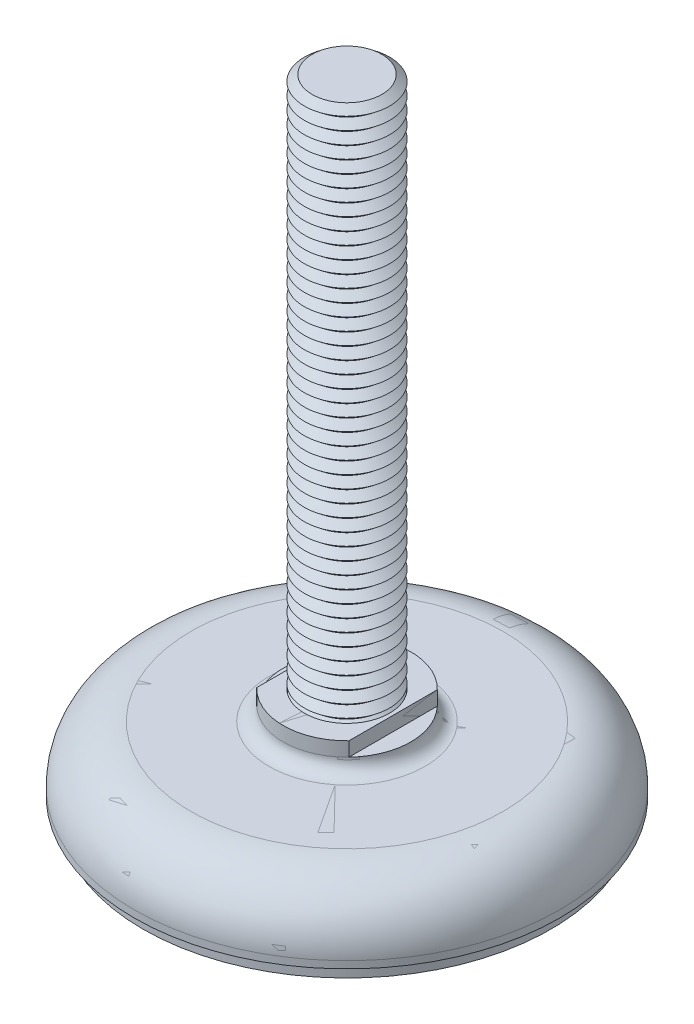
ISO-10303-21;
HEADER;
FILE_DESCRIPTION(('STEP AP214'),'2;1');
FILE_NAME('part.step','',(''),(''),'','','');
FILE_SCHEMA(('AUTOMOTIVE_DESIGN { 1 0 10303 214 1 1 1 1 }'));
ENDSEC;
DATA;
#1=APPLICATION_CONTEXT('core data for automotive mechanical design processes');
#2=APPLICATION_PROTOCOL_DEFINITION('international standard','automotive_design',2000,#1);
#3=PRODUCT_CONTEXT('',#1,'mechanical');
#4=PRODUCT('Part','Part','',(#3));
#5=PRODUCT_RELATED_PRODUCT_CATEGORY('part','',(#4));
#6=PRODUCT_DEFINITION_FORMATION('','',#4);
#7=PRODUCT_DEFINITION_CONTEXT('part definition',#1,'design');
#8=PRODUCT_DEFINITION('design','',#6,#7);
#9=PRODUCT_DEFINITION_SHAPE('','',#8);
#10=(LENGTH_UNIT() NAMED_UNIT(*) SI_UNIT(.MILLI.,.METRE.));
#11=(NAMED_UNIT(*) PLANE_ANGLE_UNIT() SI_UNIT($,.RADIAN.));
#12=(NAMED_UNIT(*) SI_UNIT($,.STERADIAN.) SOLID_ANGLE_UNIT());
#13=UNCERTAINTY_MEASURE_WITH_UNIT(LENGTH_MEASURE(1.E-05),#10,'distance_accuracy_value','');
#14=(GEOMETRIC_REPRESENTATION_CONTEXT(3) GLOBAL_UNCERTAINTY_ASSIGNED_CONTEXT((#13)) GLOBAL_UNIT_ASSIGNED_CONTEXT((#10,
#11,#12)) REPRESENTATION_CONTEXT('',''));
#15=CARTESIAN_POINT('',(0.,0.,0.));
#16=DIRECTION('',(0.,0.,1.));
#17=DIRECTION('',(1.,0.,0.));
#18=AXIS2_PLACEMENT_3D('',#15,#16,#17);
#19=CARTESIAN_POINT('',(0.,85.25,0.));
#20=DIRECTION('',(0.,-1.,0.));
#21=DIRECTION('',(0.998136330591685,0.,-0.0610234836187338));
#22=AXIS2_PLACEMENT_3D('',#19,#20,#21);
#23=CONICAL_SURFACE('',#22,4.90712535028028,0.895664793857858);
#24=CARTESIAN_POINT('',(0.,84.375,0.));
#25=DIRECTION('',(0.,-1.,0.));
#26=DIRECTION('',(0.998136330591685,0.,-0.0610234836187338));
#27=AXIS2_PLACEMENT_3D('',#24,#25,#26);
#28=CIRCLE('',#27,6.);
#29=CARTESIAN_POINT('',(5.98881798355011,84.375,-0.366140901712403));
#30=VERTEX_POINT('',#29);
#31=EDGE_CURVE('P0_E37',#30,#30,#28,.T.);
#32=ORIENTED_EDGE('',*,*,#31,.F.);
#33=EDGE_LOOP('',(#32));
#34=FACE_BOUND('',#33,.T.);
#35=CARTESIAN_POINT('',(0.,85.25,0.));
#36=DIRECTION('',(0.,-1.,0.));
#37=DIRECTION('',(0.998136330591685,0.,-0.0610234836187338));
#38=AXIS2_PLACEMENT_3D('',#35,#36,#37);
#39=CIRCLE('',#38,4.90712535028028);
#40=CARTESIAN_POINT('',(4.8979800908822,85.25,-0.299449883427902));
#41=VERTEX_POINT('',#40);
#42=EDGE_CURVE('P0_E25',#41,#41,#39,.T.);
#43=ORIENTED_EDGE('',*,*,#42,.T.);
#44=EDGE_LOOP('',(#43));
#45=FACE_BOUND('',#44,.T.);
#46=ADVANCED_FACE('P0_F14',(#34,#45),#23,.T.);
#47=CARTESIAN_POINT('',(0.,86.125,0.));
#48=DIRECTION('',(0.,1.,0.));
#49=DIRECTION('',(-0.998136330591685,0.,0.0610234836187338));
#50=AXIS2_PLACEMENT_3D('',#47,#48,#49);
#51=CONICAL_SURFACE('',#50,6.,0.895664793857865);
#52=ORIENTED_EDGE('',*,*,#42,.F.);
#53=EDGE_LOOP('',(#52));
#54=FACE_BOUND('',#53,.T.);
#55=CARTESIAN_POINT('',(0.,86.125,0.));
#56=DIRECTION('',(0.,-1.,0.));
#57=DIRECTION('',(0.998136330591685,0.,-0.0610234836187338));
#58=AXIS2_PLACEMENT_3D('',#55,#56,#57);
#59=CIRCLE('',#58,6.);
#60=CARTESIAN_POINT('',(5.98881798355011,86.125,-0.366140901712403));
#61=VERTEX_POINT('',#60);
#62=EDGE_CURVE('P0_E29',#61,#61,#59,.T.);
#63=ORIENTED_EDGE('',*,*,#62,.T.);
#64=EDGE_LOOP('',(#63));
#65=FACE_BOUND('',#64,.T.);
#66=ADVANCED_FACE('P0_F853',(#54,#65),#51,.T.);
#67=CARTESIAN_POINT('',(0.,87.,0.));
#68=DIRECTION('',(0.,1.,0.));
#69=DIRECTION('',(-0.998136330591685,0.,0.0610234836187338));
#70=AXIS2_PLACEMENT_3D('',#67,#68,#69);
#71=PLANE('',#70);
#72=CARTESIAN_POINT('',(0.,87.,0.));
#73=DIRECTION('',(0.,-1.,0.));
#74=DIRECTION('',(0.998136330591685,0.,-0.0610234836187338));
#75=AXIS2_PLACEMENT_3D('',#72,#73,#74);
#76=CIRCLE('',#75,4.90712535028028);
#77=CARTESIAN_POINT('',(4.8979800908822,87.,-0.299449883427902));
#78=VERTEX_POINT('',#77);
#79=EDGE_CURVE('P0_E21',#78,#78,#76,.T.);
#80=ORIENTED_EDGE('',*,*,#79,.F.);
#81=EDGE_LOOP('',(#80));
#82=FACE_BOUND('',#81,.T.);
#83=ADVANCED_FACE('P0_F859',(#82),#71,.T.);
#84=CARTESIAN_POINT('',(0.,87.,0.));
#85=DIRECTION('',(0.,-1.,0.));
#86=DIRECTION('',(0.998136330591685,0.,-0.0610234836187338));
#87=AXIS2_PLACEMENT_3D('',#84,#85,#86);
#88=CONICAL_SURFACE('',#87,4.90712535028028,0.895664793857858);
#89=ORIENTED_EDGE('',*,*,#62,.F.);
#90=EDGE_LOOP('',(#89));
#91=FACE_BOUND('',#90,.T.);
#92=ORIENTED_EDGE('',*,*,#79,.T.);
#93=EDGE_LOOP('',(#92));
#94=FACE_BOUND('',#93,.T.);
#95=ADVANCED_FACE('P0_F842',(#91,#94),#88,.T.);
#96=CARTESIAN_POINT('',(0.,83.5,0.));
#97=DIRECTION('',(0.,-1.,0.));
#98=DIRECTION('',(0.998136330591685,0.,-0.0610234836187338));
#99=AXIS2_PLACEMENT_3D('',#96,#97,#98);
#100=CONICAL_SURFACE('',#99,4.90712535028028,0.895664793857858);
#101=CARTESIAN_POINT('',(0.,82.625,0.));
#102=DIRECTION('',(0.,-1.,0.));
#103=DIRECTION('',(0.998136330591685,0.,-0.0610234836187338));
#104=AXIS2_PLACEMENT_3D('',#101,#102,#103);
#105=CIRCLE('',#104,6.);
#106=CARTESIAN_POINT('',(5.98881798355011,82.625,-0.366140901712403));
#107=VERTEX_POINT('',#106);
#108=EDGE_CURVE('P0_E43',#107,#107,#105,.T.);
#109=ORIENTED_EDGE('',*,*,#108,.F.);
#110=EDGE_LOOP('',(#109));
#111=FACE_BOUND('',#110,.T.);
#112=CARTESIAN_POINT('',(0.,83.5,0.));
#113=DIRECTION('',(0.,-1.,0.));
#114=DIRECTION('',(0.998136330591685,0.,-0.0610234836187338));
#115=AXIS2_PLACEMENT_3D('',#112,#113,#114);
#116=CIRCLE('',#115,4.90712535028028);
#117=CARTESIAN_POINT('',(4.8979800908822,83.5,-0.299449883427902));
#118=VERTEX_POINT('',#117);
#119=EDGE_CURVE('P0_E34',#118,#118,#116,.T.);
#120=ORIENTED_EDGE('',*,*,#119,.T.);
#121=EDGE_LOOP('',(#120));
#122=FACE_BOUND('',#121,.T.);
#123=ADVANCED_FACE('P0_F839',(#111,#122),#100,.T.);
#124=CARTESIAN_POINT('',(0.,84.375,0.));
#125=DIRECTION('',(0.,1.,0.));
#126=DIRECTION('',(-0.998136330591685,0.,0.0610234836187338));
#127=AXIS2_PLACEMENT_3D('',#124,#125,#126);
#128=CONICAL_SURFACE('',#127,6.,0.895664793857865);
#129=ORIENTED_EDGE('',*,*,#119,.F.);
#130=EDGE_LOOP('',(#129));
#131=FACE_BOUND('',#130,.T.);
#132=ORIENTED_EDGE('',*,*,#31,.T.);
#133=EDGE_LOOP('',(#132));
#134=FACE_BOUND('',#133,.T.);
#135=ADVANCED_FACE('P0_F830',(#131,#134),#128,.T.);
#136=CARTESIAN_POINT('',(0.,81.75,0.));
#137=DIRECTION('',(0.,-1.,0.));
#138=DIRECTION('',(0.998136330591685,0.,-0.0610234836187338));
#139=AXIS2_PLACEMENT_3D('',#136,#137,#138);
#140=CONICAL_SURFACE('',#139,4.90712535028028,0.895664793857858);
#141=CARTESIAN_POINT('',(0.,80.875,0.));
#142=DIRECTION('',(0.,-1.,0.));
#143=DIRECTION('',(0.998136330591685,0.,-0.0610234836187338));
#144=AXIS2_PLACEMENT_3D('',#141,#142,#143);
#145=CIRCLE('',#144,6.);
#146=CARTESIAN_POINT('',(5.98881798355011,80.875,-0.366140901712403));
#147=VERTEX_POINT('',#146);
#148=EDGE_CURVE('P0_E49',#147,#147,#145,.T.);
#149=ORIENTED_EDGE('',*,*,#148,.F.);
#150=EDGE_LOOP('',(#149));
#151=FACE_BOUND('',#150,.T.);
#152=CARTESIAN_POINT('',(0.,81.75,0.));
#153=DIRECTION('',(0.,-1.,0.));
#154=DIRECTION('',(0.998136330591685,0.,-0.0610234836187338));
#155=AXIS2_PLACEMENT_3D('',#152,#153,#154);
#156=CIRCLE('',#155,4.90712535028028);
#157=CARTESIAN_POINT('',(4.8979800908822,81.75,-0.299449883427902));
#158=VERTEX_POINT('',#157);
#159=EDGE_CURVE('P0_E40',#158,#158,#156,.T.);
#160=ORIENTED_EDGE('',*,*,#159,.T.);
#161=EDGE_LOOP('',(#160));
#162=FACE_BOUND('',#161,.T.);
#163=ADVANCED_FACE('P0_F827',(#151,#162),#140,.T.);
#164=CARTESIAN_POINT('',(0.,82.625,0.));
#165=DIRECTION('',(0.,1.,0.));
#166=DIRECTION('',(-0.998136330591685,0.,0.0610234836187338));
#167=AXIS2_PLACEMENT_3D('',#164,#165,#166);
#168=CONICAL_SURFACE('',#167,6.,0.895664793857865);
#169=ORIENTED_EDGE('',*,*,#159,.F.);
#170=EDGE_LOOP('',(#169));
#171=FACE_BOUND('',#170,.T.);
#172=ORIENTED_EDGE('',*,*,#108,.T.);
#173=EDGE_LOOP('',(#172));
#174=FACE_BOUND('',#173,.T.);
#175=ADVANCED_FACE('P0_F818',(#171,#174),#168,.T.);
#176=CARTESIAN_POINT('',(0.,80.,0.));
#177=DIRECTION('',(0.,-1.,0.));
#178=DIRECTION('',(0.998136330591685,0.,-0.0610234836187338));
#179=AXIS2_PLACEMENT_3D('',#176,#177,#178);
#180=CONICAL_SURFACE('',#179,4.90712535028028,0.895664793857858);
#181=CARTESIAN_POINT('',(0.,79.125,0.));
#182=DIRECTION('',(0.,-1.,0.));
#183=DIRECTION('',(0.998136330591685,0.,-0.0610234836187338));
#184=AXIS2_PLACEMENT_3D('',#181,#182,#183);
#185=CIRCLE('',#184,6.);
#186=CARTESIAN_POINT('',(5.98881798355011,79.125,-0.366140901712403));
#187=VERTEX_POINT('',#186);
#188=EDGE_CURVE('P0_E55',#187,#187,#185,.T.);
#189=ORIENTED_EDGE('',*,*,#188,.F.);
#190=EDGE_LOOP('',(#189));
#191=FACE_BOUND('',#190,.T.);
#192=CARTESIAN_POINT('',(0.,80.,0.));
#193=DIRECTION('',(0.,-1.,0.));
#194=DIRECTION('',(0.998136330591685,0.,-0.0610234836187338));
#195=AXIS2_PLACEMENT_3D('',#192,#193,#194);
#196=CIRCLE('',#195,4.90712535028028);
#197=CARTESIAN_POINT('',(4.8979800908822,80.,-0.299449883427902));
#198=VERTEX_POINT('',#197);
#199=EDGE_CURVE('P0_E46',#198,#198,#196,.T.);
#200=ORIENTED_EDGE('',*,*,#199,.T.);
#201=EDGE_LOOP('',(#200));
#202=FACE_BOUND('',#201,.T.);
#203=ADVANCED_FACE('P0_F815',(#191,#202),#180,.T.);
#204=CARTESIAN_POINT('',(0.,80.875,0.));
#205=DIRECTION('',(0.,1.,0.));
#206=DIRECTION('',(-0.998136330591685,0.,0.0610234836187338));
#207=AXIS2_PLACEMENT_3D('',#204,#205,#206);
#208=CONICAL_SURFACE('',#207,6.,0.895664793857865);
#209=ORIENTED_EDGE('',*,*,#199,.F.);
#210=EDGE_LOOP('',(#209));
#211=FACE_BOUND('',#210,.T.);
#212=ORIENTED_EDGE('',*,*,#148,.T.);
#213=EDGE_LOOP('',(#212));
#214=FACE_BOUND('',#213,.T.);
#215=ADVANCED_FACE('P0_F806',(#211,#214),#208,.T.);
#216=CARTESIAN_POINT('',(0.,78.25,0.));
#217=DIRECTION('',(0.,-1.,0.));
#218=DIRECTION('',(0.998136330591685,0.,-0.0610234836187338));
#219=AXIS2_PLACEMENT_3D('',#216,#217,#218);
#220=CONICAL_SURFACE('',#219,4.90712535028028,0.895664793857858);
#221=CARTESIAN_POINT('',(0.,77.375,0.));
#222=DIRECTION('',(0.,-1.,0.));
#223=DIRECTION('',(0.998136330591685,0.,-0.0610234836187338));
#224=AXIS2_PLACEMENT_3D('',#221,#222,#223);
#225=CIRCLE('',#224,6.);
#226=CARTESIAN_POINT('',(5.98881798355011,77.375,-0.366140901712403));
#227=VERTEX_POINT('',#226);
#228=EDGE_CURVE('P0_E61',#227,#227,#225,.T.);
#229=ORIENTED_EDGE('',*,*,#228,.F.);
#230=EDGE_LOOP('',(#229));
#231=FACE_BOUND('',#230,.T.);
#232=CARTESIAN_POINT('',(0.,78.25,0.));
#233=DIRECTION('',(0.,-1.,0.));
#234=DIRECTION('',(0.998136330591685,0.,-0.0610234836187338));
#235=AXIS2_PLACEMENT_3D('',#232,#233,#234);
#236=CIRCLE('',#235,4.90712535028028);
#237=CARTESIAN_POINT('',(4.8979800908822,78.25,-0.299449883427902));
#238=VERTEX_POINT('',#237);
#239=EDGE_CURVE('P0_E52',#238,#238,#236,.T.);
#240=ORIENTED_EDGE('',*,*,#239,.T.);
#241=EDGE_LOOP('',(#240));
#242=FACE_BOUND('',#241,.T.);
#243=ADVANCED_FACE('P0_F803',(#231,#242),#220,.T.);
#244=CARTESIAN_POINT('',(0.,79.125,0.));
#245=DIRECTION('',(0.,1.,0.));
#246=DIRECTION('',(-0.998136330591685,0.,0.0610234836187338));
#247=AXIS2_PLACEMENT_3D('',#244,#245,#246);
#248=CONICAL_SURFACE('',#247,6.,0.895664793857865);
#249=ORIENTED_EDGE('',*,*,#239,.F.);
#250=EDGE_LOOP('',(#249));
#251=FACE_BOUND('',#250,.T.);
#252=ORIENTED_EDGE('',*,*,#188,.T.);
#253=EDGE_LOOP('',(#252));
#254=FACE_BOUND('',#253,.T.);
#255=ADVANCED_FACE('P0_F794',(#251,#254),#248,.T.);
#256=CARTESIAN_POINT('',(0.,76.5,0.));
#257=DIRECTION('',(0.,-1.,0.));
#258=DIRECTION('',(0.998136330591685,0.,-0.0610234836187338));
#259=AXIS2_PLACEMENT_3D('',#256,#257,#258);
#260=CONICAL_SURFACE('',#259,4.90712535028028,0.895664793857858);
#261=CARTESIAN_POINT('',(0.,75.625,0.));
#262=DIRECTION('',(0.,-1.,0.));
#263=DIRECTION('',(0.998136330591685,0.,-0.0610234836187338));
#264=AXIS2_PLACEMENT_3D('',#261,#262,#263);
#265=CIRCLE('',#264,6.);
#266=CARTESIAN_POINT('',(5.98881798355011,75.625,-0.366140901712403));
#267=VERTEX_POINT('',#266);
#268=EDGE_CURVE('P0_E67',#267,#267,#265,.T.);
#269=ORIENTED_EDGE('',*,*,#268,.F.);
#270=EDGE_LOOP('',(#269));
#271=FACE_BOUND('',#270,.T.);
#272=CARTESIAN_POINT('',(0.,76.5,0.));
#273=DIRECTION('',(0.,-1.,0.));
#274=DIRECTION('',(0.998136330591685,0.,-0.0610234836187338));
#275=AXIS2_PLACEMENT_3D('',#272,#273,#274);
#276=CIRCLE('',#275,4.90712535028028);
#277=CARTESIAN_POINT('',(4.8979800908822,76.5,-0.299449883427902));
#278=VERTEX_POINT('',#277);
#279=EDGE_CURVE('P0_E58',#278,#278,#276,.T.);
#280=ORIENTED_EDGE('',*,*,#279,.T.);
#281=EDGE_LOOP('',(#280));
#282=FACE_BOUND('',#281,.T.);
#283=ADVANCED_FACE('P0_F791',(#271,#282),#260,.T.);
#284=CARTESIAN_POINT('',(0.,77.375,0.));
#285=DIRECTION('',(0.,1.,0.));
#286=DIRECTION('',(-0.998136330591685,0.,0.0610234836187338));
#287=AXIS2_PLACEMENT_3D('',#284,#285,#286);
#288=CONICAL_SURFACE('',#287,6.,0.895664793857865);
#289=ORIENTED_EDGE('',*,*,#279,.F.);
#290=EDGE_LOOP('',(#289));
#291=FACE_BOUND('',#290,.T.);
#292=ORIENTED_EDGE('',*,*,#228,.T.);
#293=EDGE_LOOP('',(#292));
#294=FACE_BOUND('',#293,.T.);
#295=ADVANCED_FACE('P0_F782',(#291,#294),#288,.T.);
#296=CARTESIAN_POINT('',(0.,74.75,0.));
#297=DIRECTION('',(0.,-1.,0.));
#298=DIRECTION('',(0.998136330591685,0.,-0.0610234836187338));
#299=AXIS2_PLACEMENT_3D('',#296,#297,#298);
#300=CONICAL_SURFACE('',#299,4.90712535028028,0.895664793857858);
#301=CARTESIAN_POINT('',(0.,73.875,0.));
#302=DIRECTION('',(0.,-1.,0.));
#303=DIRECTION('',(0.998136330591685,0.,-0.0610234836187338));
#304=AXIS2_PLACEMENT_3D('',#301,#302,#303);
#305=CIRCLE('',#304,6.);
#306=CARTESIAN_POINT('',(5.98881798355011,73.875,-0.366140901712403));
#307=VERTEX_POINT('',#306);
#308=EDGE_CURVE('P0_E73',#307,#307,#305,.T.);
#309=ORIENTED_EDGE('',*,*,#308,.F.);
#310=EDGE_LOOP('',(#309));
#311=FACE_BOUND('',#310,.T.);
#312=CARTESIAN_POINT('',(0.,74.75,0.));
#313=DIRECTION('',(0.,-1.,0.));
#314=DIRECTION('',(0.998136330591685,0.,-0.0610234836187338));
#315=AXIS2_PLACEMENT_3D('',#312,#313,#314);
#316=CIRCLE('',#315,4.90712535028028);
#317=CARTESIAN_POINT('',(4.8979800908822,74.75,-0.299449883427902));
#318=VERTEX_POINT('',#317);
#319=EDGE_CURVE('P0_E64',#318,#318,#316,.T.);
#320=ORIENTED_EDGE('',*,*,#319,.T.);
#321=EDGE_LOOP('',(#320));
#322=FACE_BOUND('',#321,.T.);
#323=ADVANCED_FACE('P0_F779',(#311,#322),#300,.T.);
#324=CARTESIAN_POINT('',(0.,75.625,0.));
#325=DIRECTION('',(0.,1.,0.));
#326=DIRECTION('',(-0.998136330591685,0.,0.0610234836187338));
#327=AXIS2_PLACEMENT_3D('',#324,#325,#326);
#328=CONICAL_SURFACE('',#327,6.,0.895664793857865);
#329=ORIENTED_EDGE('',*,*,#319,.F.);
#330=EDGE_LOOP('',(#329));
#331=FACE_BOUND('',#330,.T.);
#332=ORIENTED_EDGE('',*,*,#268,.T.);
#333=EDGE_LOOP('',(#332));
#334=FACE_BOUND('',#333,.T.);
#335=ADVANCED_FACE('P0_F770',(#331,#334),#328,.T.);
#336=CARTESIAN_POINT('',(0.,73.,0.));
#337=DIRECTION('',(0.,-1.,0.));
#338=DIRECTION('',(0.998136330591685,0.,-0.0610234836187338));
#339=AXIS2_PLACEMENT_3D('',#336,#337,#338);
#340=CONICAL_SURFACE('',#339,4.90712535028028,0.895664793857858);
#341=CARTESIAN_POINT('',(0.,72.125,0.));
#342=DIRECTION('',(0.,-1.,0.));
#343=DIRECTION('',(0.998136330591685,0.,-0.0610234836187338));
#344=AXIS2_PLACEMENT_3D('',#341,#342,#343);
#345=CIRCLE('',#344,6.);
#346=CARTESIAN_POINT('',(5.98881798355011,72.125,-0.366140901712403));
#347=VERTEX_POINT('',#346);
#348=EDGE_CURVE('P0_E79',#347,#347,#345,.T.);
#349=ORIENTED_EDGE('',*,*,#348,.F.);
#350=EDGE_LOOP('',(#349));
#351=FACE_BOUND('',#350,.T.);
#352=CARTESIAN_POINT('',(0.,73.,0.));
#353=DIRECTION('',(0.,-1.,0.));
#354=DIRECTION('',(0.998136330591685,0.,-0.0610234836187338));
#355=AXIS2_PLACEMENT_3D('',#352,#353,#354);
#356=CIRCLE('',#355,4.90712535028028);
#357=CARTESIAN_POINT('',(4.8979800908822,73.,-0.299449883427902));
#358=VERTEX_POINT('',#357);
#359=EDGE_CURVE('P0_E70',#358,#358,#356,.T.);
#360=ORIENTED_EDGE('',*,*,#359,.T.);
#361=EDGE_LOOP('',(#360));
#362=FACE_BOUND('',#361,.T.);
#363=ADVANCED_FACE('P0_F767',(#351,#362),#340,.T.);
#364=CARTESIAN_POINT('',(0.,73.875,0.));
#365=DIRECTION('',(0.,1.,0.));
#366=DIRECTION('',(-0.998136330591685,0.,0.0610234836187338));
#367=AXIS2_PLACEMENT_3D('',#364,#365,#366);
#368=CONICAL_SURFACE('',#367,6.,0.895664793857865);
#369=ORIENTED_EDGE('',*,*,#359,.F.);
#370=EDGE_LOOP('',(#369));
#371=FACE_BOUND('',#370,.T.);
#372=ORIENTED_EDGE('',*,*,#308,.T.);
#373=EDGE_LOOP('',(#372));
#374=FACE_BOUND('',#373,.T.);
#375=ADVANCED_FACE('P0_F758',(#371,#374),#368,.T.);
#376=CARTESIAN_POINT('',(0.,71.25,0.));
#377=DIRECTION('',(0.,-1.,0.));
#378=DIRECTION('',(0.998136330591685,0.,-0.0610234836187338));
#379=AXIS2_PLACEMENT_3D('',#376,#377,#378);
#380=CONICAL_SURFACE('',#379,4.90712535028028,0.895664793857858);
#381=CARTESIAN_POINT('',(0.,70.375,0.));
#382=DIRECTION('',(0.,-1.,0.));
#383=DIRECTION('',(0.998136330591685,0.,-0.0610234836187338));
#384=AXIS2_PLACEMENT_3D('',#381,#382,#383);
#385=CIRCLE('',#384,6.);
#386=CARTESIAN_POINT('',(5.98881798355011,70.375,-0.366140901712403));
#387=VERTEX_POINT('',#386);
#388=EDGE_CURVE('P0_E85',#387,#387,#385,.T.);
#389=ORIENTED_EDGE('',*,*,#388,.F.);
#390=EDGE_LOOP('',(#389));
#391=FACE_BOUND('',#390,.T.);
#392=CARTESIAN_POINT('',(0.,71.25,0.));
#393=DIRECTION('',(0.,-1.,0.));
#394=DIRECTION('',(0.998136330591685,0.,-0.0610234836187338));
#395=AXIS2_PLACEMENT_3D('',#392,#393,#394);
#396=CIRCLE('',#395,4.90712535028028);
#397=CARTESIAN_POINT('',(4.8979800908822,71.25,-0.299449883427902));
#398=VERTEX_POINT('',#397);
#399=EDGE_CURVE('P0_E76',#398,#398,#396,.T.);
#400=ORIENTED_EDGE('',*,*,#399,.T.);
#401=EDGE_LOOP('',(#400));
#402=FACE_BOUND('',#401,.T.);
#403=ADVANCED_FACE('P0_F755',(#391,#402),#380,.T.);
#404=CARTESIAN_POINT('',(0.,72.125,0.));
#405=DIRECTION('',(0.,1.,0.));
#406=DIRECTION('',(-0.998136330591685,0.,0.0610234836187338));
#407=AXIS2_PLACEMENT_3D('',#404,#405,#406);
#408=CONICAL_SURFACE('',#407,6.,0.895664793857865);
#409=ORIENTED_EDGE('',*,*,#399,.F.);
#410=EDGE_LOOP('',(#409));
#411=FACE_BOUND('',#410,.T.);
#412=ORIENTED_EDGE('',*,*,#348,.T.);
#413=EDGE_LOOP('',(#412));
#414=FACE_BOUND('',#413,.T.);
#415=ADVANCED_FACE('P0_F746',(#411,#414),#408,.T.);
#416=CARTESIAN_POINT('',(0.,69.5,0.));
#417=DIRECTION('',(0.,-1.,0.));
#418=DIRECTION('',(0.998136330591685,0.,-0.0610234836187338));
#419=AXIS2_PLACEMENT_3D('',#416,#417,#418);
#420=CONICAL_SURFACE('',#419,4.90712535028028,0.895664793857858);
#421=CARTESIAN_POINT('',(0.,68.625,0.));
#422=DIRECTION('',(0.,-1.,0.));
#423=DIRECTION('',(0.998136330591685,0.,-0.0610234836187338));
#424=AXIS2_PLACEMENT_3D('',#421,#422,#423);
#425=CIRCLE('',#424,6.);
#426=CARTESIAN_POINT('',(5.98881798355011,68.625,-0.366140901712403));
#427=VERTEX_POINT('',#426);
#428=EDGE_CURVE('P0_E91',#427,#427,#425,.T.);
#429=ORIENTED_EDGE('',*,*,#428,.F.);
#430=EDGE_LOOP('',(#429));
#431=FACE_BOUND('',#430,.T.);
#432=CARTESIAN_POINT('',(0.,69.5,0.));
#433=DIRECTION('',(0.,-1.,0.));
#434=DIRECTION('',(0.998136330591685,0.,-0.0610234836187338));
#435=AXIS2_PLACEMENT_3D('',#432,#433,#434);
#436=CIRCLE('',#435,4.90712535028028);
#437=CARTESIAN_POINT('',(4.8979800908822,69.5,-0.299449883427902));
#438=VERTEX_POINT('',#437);
#439=EDGE_CURVE('P0_E82',#438,#438,#436,.T.);
#440=ORIENTED_EDGE('',*,*,#439,.T.);
#441=EDGE_LOOP('',(#440));
#442=FACE_BOUND('',#441,.T.);
#443=ADVANCED_FACE('P0_F743',(#431,#442),#420,.T.);
#444=CARTESIAN_POINT('',(0.,70.375,0.));
#445=DIRECTION('',(0.,1.,0.));
#446=DIRECTION('',(-0.998136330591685,0.,0.0610234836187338));
#447=AXIS2_PLACEMENT_3D('',#444,#445,#446);
#448=CONICAL_SURFACE('',#447,6.,0.895664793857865);
#449=ORIENTED_EDGE('',*,*,#439,.F.);
#450=EDGE_LOOP('',(#449));
#451=FACE_BOUND('',#450,.T.);
#452=ORIENTED_EDGE('',*,*,#388,.T.);
#453=EDGE_LOOP('',(#452));
#454=FACE_BOUND('',#453,.T.);
#455=ADVANCED_FACE('P0_F734',(#451,#454),#448,.T.);
#456=CARTESIAN_POINT('',(0.,67.75,0.));
#457=DIRECTION('',(0.,-1.,0.));
#458=DIRECTION('',(0.998136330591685,0.,-0.0610234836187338));
#459=AXIS2_PLACEMENT_3D('',#456,#457,#458);
#460=CONICAL_SURFACE('',#459,4.90712535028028,0.895664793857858);
#461=CARTESIAN_POINT('',(0.,66.875,0.));
#462=DIRECTION('',(0.,-1.,0.));
#463=DIRECTION('',(0.998136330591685,0.,-0.0610234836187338));
#464=AXIS2_PLACEMENT_3D('',#461,#462,#463);
#465=CIRCLE('',#464,6.);
#466=CARTESIAN_POINT('',(5.98881798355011,66.875,-0.366140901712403));
#467=VERTEX_POINT('',#466);
#468=EDGE_CURVE('P0_E97',#467,#467,#465,.T.);
#469=ORIENTED_EDGE('',*,*,#468,.F.);
#470=EDGE_LOOP('',(#469));
#471=FACE_BOUND('',#470,.T.);
#472=CARTESIAN_POINT('',(0.,67.75,0.));
#473=DIRECTION('',(0.,-1.,0.));
#474=DIRECTION('',(0.998136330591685,0.,-0.0610234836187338));
#475=AXIS2_PLACEMENT_3D('',#472,#473,#474);
#476=CIRCLE('',#475,4.90712535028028);
#477=CARTESIAN_POINT('',(4.8979800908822,67.75,-0.299449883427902));
#478=VERTEX_POINT('',#477);
#479=EDGE_CURVE('P0_E88',#478,#478,#476,.T.);
#480=ORIENTED_EDGE('',*,*,#479,.T.);
#481=EDGE_LOOP('',(#480));
#482=FACE_BOUND('',#481,.T.);
#483=ADVANCED_FACE('P0_F731',(#471,#482),#460,.T.);
#484=CARTESIAN_POINT('',(0.,68.625,0.));
#485=DIRECTION('',(0.,1.,0.));
#486=DIRECTION('',(-0.998136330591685,0.,0.0610234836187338));
#487=AXIS2_PLACEMENT_3D('',#484,#485,#486);
#488=CONICAL_SURFACE('',#487,6.,0.895664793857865);
#489=ORIENTED_EDGE('',*,*,#479,.F.);
#490=EDGE_LOOP('',(#489));
#491=FACE_BOUND('',#490,.T.);
#492=ORIENTED_EDGE('',*,*,#428,.T.);
#493=EDGE_LOOP('',(#492));
#494=FACE_BOUND('',#493,.T.);
#495=ADVANCED_FACE('P0_F722',(#491,#494),#488,.T.);
#496=CARTESIAN_POINT('',(0.,66.,0.));
#497=DIRECTION('',(0.,-1.,0.));
#498=DIRECTION('',(0.998136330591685,0.,-0.0610234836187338));
#499=AXIS2_PLACEMENT_3D('',#496,#497,#498);
#500=CONICAL_SURFACE('',#499,4.90712535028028,0.895664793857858);
#501=CARTESIAN_POINT('',(0.,65.125,0.));
#502=DIRECTION('',(0.,-1.,0.));
#503=DIRECTION('',(0.998136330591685,0.,-0.0610234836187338));
#504=AXIS2_PLACEMENT_3D('',#501,#502,#503);
#505=CIRCLE('',#504,6.);
#506=CARTESIAN_POINT('',(5.98881798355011,65.125,-0.366140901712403));
#507=VERTEX_POINT('',#506);
#508=EDGE_CURVE('P0_E103',#507,#507,#505,.T.);
#509=ORIENTED_EDGE('',*,*,#508,.F.);
#510=EDGE_LOOP('',(#509));
#511=FACE_BOUND('',#510,.T.);
#512=CARTESIAN_POINT('',(0.,66.,0.));
#513=DIRECTION('',(0.,-1.,0.));
#514=DIRECTION('',(0.998136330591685,0.,-0.0610234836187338));
#515=AXIS2_PLACEMENT_3D('',#512,#513,#514);
#516=CIRCLE('',#515,4.90712535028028);
#517=CARTESIAN_POINT('',(4.8979800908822,66.,-0.299449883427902));
#518=VERTEX_POINT('',#517);
#519=EDGE_CURVE('P0_E94',#518,#518,#516,.T.);
#520=ORIENTED_EDGE('',*,*,#519,.T.);
#521=EDGE_LOOP('',(#520));
#522=FACE_BOUND('',#521,.T.);
#523=ADVANCED_FACE('P0_F719',(#511,#522),#500,.T.);
#524=CARTESIAN_POINT('',(0.,66.875,0.));
#525=DIRECTION('',(0.,1.,0.));
#526=DIRECTION('',(-0.998136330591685,0.,0.0610234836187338));
#527=AXIS2_PLACEMENT_3D('',#524,#525,#526);
#528=CONICAL_SURFACE('',#527,6.,0.895664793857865);
#529=ORIENTED_EDGE('',*,*,#519,.F.);
#530=EDGE_LOOP('',(#529));
#531=FACE_BOUND('',#530,.T.);
#532=ORIENTED_EDGE('',*,*,#468,.T.);
#533=EDGE_LOOP('',(#532));
#534=FACE_BOUND('',#533,.T.);
#535=ADVANCED_FACE('P0_F710',(#531,#534),#528,.T.);
#536=CARTESIAN_POINT('',(0.,64.25,0.));
#537=DIRECTION('',(0.,-1.,0.));
#538=DIRECTION('',(0.998136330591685,0.,-0.0610234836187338));
#539=AXIS2_PLACEMENT_3D('',#536,#537,#538);
#540=CONICAL_SURFACE('',#539,4.90712535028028,0.895664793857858);
#541=CARTESIAN_POINT('',(0.,63.375,0.));
#542=DIRECTION('',(0.,-1.,0.));
#543=DIRECTION('',(0.998136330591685,0.,-0.0610234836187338));
#544=AXIS2_PLACEMENT_3D('',#541,#542,#543);
#545=CIRCLE('',#544,6.);
#546=CARTESIAN_POINT('',(5.98881798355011,63.375,-0.366140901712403));
#547=VERTEX_POINT('',#546);
#548=EDGE_CURVE('P0_E109',#547,#547,#545,.T.);
#549=ORIENTED_EDGE('',*,*,#548,.F.);
#550=EDGE_LOOP('',(#549));
#551=FACE_BOUND('',#550,.T.);
#552=CARTESIAN_POINT('',(0.,64.25,0.));
#553=DIRECTION('',(0.,-1.,0.));
#554=DIRECTION('',(0.998136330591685,0.,-0.0610234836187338));
#555=AXIS2_PLACEMENT_3D('',#552,#553,#554);
#556=CIRCLE('',#555,4.90712535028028);
#557=CARTESIAN_POINT('',(4.8979800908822,64.25,-0.299449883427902));
#558=VERTEX_POINT('',#557);
#559=EDGE_CURVE('P0_E100',#558,#558,#556,.T.);
#560=ORIENTED_EDGE('',*,*,#559,.T.);
#561=EDGE_LOOP('',(#560));
#562=FACE_BOUND('',#561,.T.);
#563=ADVANCED_FACE('P0_F707',(#551,#562),#540,.T.);
#564=CARTESIAN_POINT('',(0.,65.125,0.));
#565=DIRECTION('',(0.,1.,0.));
#566=DIRECTION('',(-0.998136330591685,0.,0.0610234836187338));
#567=AXIS2_PLACEMENT_3D('',#564,#565,#566);
#568=CONICAL_SURFACE('',#567,6.,0.895664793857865);
#569=ORIENTED_EDGE('',*,*,#559,.F.);
#570=EDGE_LOOP('',(#569));
#571=FACE_BOUND('',#570,.T.);
#572=ORIENTED_EDGE('',*,*,#508,.T.);
#573=EDGE_LOOP('',(#572));
#574=FACE_BOUND('',#573,.T.);
#575=ADVANCED_FACE('P0_F698',(#571,#574),#568,.T.);
#576=CARTESIAN_POINT('',(0.,62.5,0.));
#577=DIRECTION('',(0.,-1.,0.));
#578=DIRECTION('',(0.998136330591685,0.,-0.0610234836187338));
#579=AXIS2_PLACEMENT_3D('',#576,#577,#578);
#580=CONICAL_SURFACE('',#579,4.90712535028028,0.895664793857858);
#581=CARTESIAN_POINT('',(0.,61.625,0.));
#582=DIRECTION('',(0.,-1.,0.));
#583=DIRECTION('',(0.998136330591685,0.,-0.0610234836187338));
#584=AXIS2_PLACEMENT_3D('',#581,#582,#583);
#585=CIRCLE('',#584,6.);
#586=CARTESIAN_POINT('',(5.98881798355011,61.625,-0.366140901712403));
#587=VERTEX_POINT('',#586);
#588=EDGE_CURVE('P0_E115',#587,#587,#585,.T.);
#589=ORIENTED_EDGE('',*,*,#588,.F.);
#590=EDGE_LOOP('',(#589));
#591=FACE_BOUND('',#590,.T.);
#592=CARTESIAN_POINT('',(0.,62.5,0.));
#593=DIRECTION('',(0.,-1.,0.));
#594=DIRECTION('',(0.998136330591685,0.,-0.0610234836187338));
#595=AXIS2_PLACEMENT_3D('',#592,#593,#594);
#596=CIRCLE('',#595,4.90712535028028);
#597=CARTESIAN_POINT('',(4.8979800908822,62.5,-0.299449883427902));
#598=VERTEX_POINT('',#597);
#599=EDGE_CURVE('P0_E106',#598,#598,#596,.T.);
#600=ORIENTED_EDGE('',*,*,#599,.T.);
#601=EDGE_LOOP('',(#600));
#602=FACE_BOUND('',#601,.T.);
#603=ADVANCED_FACE('P0_F695',(#591,#602),#580,.T.);
#604=CARTESIAN_POINT('',(0.,63.375,0.));
#605=DIRECTION('',(0.,1.,0.));
#606=DIRECTION('',(-0.998136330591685,0.,0.0610234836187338));
#607=AXIS2_PLACEMENT_3D('',#604,#605,#606);
#608=CONICAL_SURFACE('',#607,6.,0.895664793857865);
#609=ORIENTED_EDGE('',*,*,#599,.F.);
#610=EDGE_LOOP('',(#609));
#611=FACE_BOUND('',#610,.T.);
#612=ORIENTED_EDGE('',*,*,#548,.T.);
#613=EDGE_LOOP('',(#612));
#614=FACE_BOUND('',#613,.T.);
#615=ADVANCED_FACE('P0_F686',(#611,#614),#608,.T.);
#616=CARTESIAN_POINT('',(0.,60.75,0.));
#617=DIRECTION('',(0.,-1.,0.));
#618=DIRECTION('',(0.998136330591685,0.,-0.0610234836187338));
#619=AXIS2_PLACEMENT_3D('',#616,#617,#618);
#620=CONICAL_SURFACE('',#619,4.90712535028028,0.895664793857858);
#621=CARTESIAN_POINT('',(0.,59.875,0.));
#622=DIRECTION('',(0.,-1.,0.));
#623=DIRECTION('',(0.998136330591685,0.,-0.0610234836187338));
#624=AXIS2_PLACEMENT_3D('',#621,#622,#623);
#625=CIRCLE('',#624,6.);
#626=CARTESIAN_POINT('',(5.98881798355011,59.875,-0.366140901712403));
#627=VERTEX_POINT('',#626);
#628=EDGE_CURVE('P0_E121',#627,#627,#625,.T.);
#629=ORIENTED_EDGE('',*,*,#628,.F.);
#630=EDGE_LOOP('',(#629));
#631=FACE_BOUND('',#630,.T.);
#632=CARTESIAN_POINT('',(0.,60.75,0.));
#633=DIRECTION('',(0.,-1.,0.));
#634=DIRECTION('',(0.998136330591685,0.,-0.0610234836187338));
#635=AXIS2_PLACEMENT_3D('',#632,#633,#634);
#636=CIRCLE('',#635,4.90712535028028);
#637=CARTESIAN_POINT('',(4.8979800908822,60.75,-0.299449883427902));
#638=VERTEX_POINT('',#637);
#639=EDGE_CURVE('P0_E112',#638,#638,#636,.T.);
#640=ORIENTED_EDGE('',*,*,#639,.T.);
#641=EDGE_LOOP('',(#640));
#642=FACE_BOUND('',#641,.T.);
#643=ADVANCED_FACE('P0_F683',(#631,#642),#620,.T.);
#644=CARTESIAN_POINT('',(0.,61.625,0.));
#645=DIRECTION('',(0.,1.,0.));
#646=DIRECTION('',(-0.998136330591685,0.,0.0610234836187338));
#647=AXIS2_PLACEMENT_3D('',#644,#645,#646);
#648=CONICAL_SURFACE('',#647,6.,0.895664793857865);
#649=ORIENTED_EDGE('',*,*,#639,.F.);
#650=EDGE_LOOP('',(#649));
#651=FACE_BOUND('',#650,.T.);
#652=ORIENTED_EDGE('',*,*,#588,.T.);
#653=EDGE_LOOP('',(#652));
#654=FACE_BOUND('',#653,.T.);
#655=ADVANCED_FACE('P0_F674',(#651,#654),#648,.T.);
#656=CARTESIAN_POINT('',(0.,59.,0.));
#657=DIRECTION('',(0.,-1.,0.));
#658=DIRECTION('',(0.998136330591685,0.,-0.0610234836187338));
#659=AXIS2_PLACEMENT_3D('',#656,#657,#658);
#660=CONICAL_SURFACE('',#659,4.90712535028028,0.895664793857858);
#661=CARTESIAN_POINT('',(0.,58.125,0.));
#662=DIRECTION('',(0.,-1.,0.));
#663=DIRECTION('',(0.998136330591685,0.,-0.0610234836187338));
#664=AXIS2_PLACEMENT_3D('',#661,#662,#663);
#665=CIRCLE('',#664,6.);
#666=CARTESIAN_POINT('',(5.98881798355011,58.125,-0.366140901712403));
#667=VERTEX_POINT('',#666);
#668=EDGE_CURVE('P0_E127',#667,#667,#665,.T.);
#669=ORIENTED_EDGE('',*,*,#668,.F.);
#670=EDGE_LOOP('',(#669));
#671=FACE_BOUND('',#670,.T.);
#672=CARTESIAN_POINT('',(0.,59.,0.));
#673=DIRECTION('',(0.,-1.,0.));
#674=DIRECTION('',(0.998136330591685,0.,-0.0610234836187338));
#675=AXIS2_PLACEMENT_3D('',#672,#673,#674);
#676=CIRCLE('',#675,4.90712535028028);
#677=CARTESIAN_POINT('',(4.8979800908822,59.,-0.299449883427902));
#678=VERTEX_POINT('',#677);
#679=EDGE_CURVE('P0_E118',#678,#678,#676,.T.);
#680=ORIENTED_EDGE('',*,*,#679,.T.);
#681=EDGE_LOOP('',(#680));
#682=FACE_BOUND('',#681,.T.);
#683=ADVANCED_FACE('P0_F671',(#671,#682),#660,.T.);
#684=CARTESIAN_POINT('',(0.,59.875,0.));
#685=DIRECTION('',(0.,1.,0.));
#686=DIRECTION('',(-0.998136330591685,0.,0.0610234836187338));
#687=AXIS2_PLACEMENT_3D('',#684,#685,#686);
#688=CONICAL_SURFACE('',#687,6.,0.895664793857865);
#689=ORIENTED_EDGE('',*,*,#679,.F.);
#690=EDGE_LOOP('',(#689));
#691=FACE_BOUND('',#690,.T.);
#692=ORIENTED_EDGE('',*,*,#628,.T.);
#693=EDGE_LOOP('',(#692));
#694=FACE_BOUND('',#693,.T.);
#695=ADVANCED_FACE('P0_F662',(#691,#694),#688,.T.);
#696=CARTESIAN_POINT('',(0.,57.25,0.));
#697=DIRECTION('',(0.,-1.,0.));
#698=DIRECTION('',(0.998136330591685,0.,-0.0610234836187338));
#699=AXIS2_PLACEMENT_3D('',#696,#697,#698);
#700=CONICAL_SURFACE('',#699,4.90712535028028,0.895664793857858);
#701=CARTESIAN_POINT('',(0.,56.375,0.));
#702=DIRECTION('',(0.,-1.,0.));
#703=DIRECTION('',(0.998136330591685,0.,-0.0610234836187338));
#704=AXIS2_PLACEMENT_3D('',#701,#702,#703);
#705=CIRCLE('',#704,6.);
#706=CARTESIAN_POINT('',(5.98881798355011,56.375,-0.366140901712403));
#707=VERTEX_POINT('',#706);
#708=EDGE_CURVE('P0_E133',#707,#707,#705,.T.);
#709=ORIENTED_EDGE('',*,*,#708,.F.);
#710=EDGE_LOOP('',(#709));
#711=FACE_BOUND('',#710,.T.);
#712=CARTESIAN_POINT('',(0.,57.25,0.));
#713=DIRECTION('',(0.,-1.,0.));
#714=DIRECTION('',(0.998136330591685,0.,-0.0610234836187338));
#715=AXIS2_PLACEMENT_3D('',#712,#713,#714);
#716=CIRCLE('',#715,4.90712535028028);
#717=CARTESIAN_POINT('',(4.8979800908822,57.25,-0.299449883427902));
#718=VERTEX_POINT('',#717);
#719=EDGE_CURVE('P0_E124',#718,#718,#716,.T.);
#720=ORIENTED_EDGE('',*,*,#719,.T.);
#721=EDGE_LOOP('',(#720));
#722=FACE_BOUND('',#721,.T.);
#723=ADVANCED_FACE('P0_F659',(#711,#722),#700,.T.);
#724=CARTESIAN_POINT('',(0.,58.125,0.));
#725=DIRECTION('',(0.,1.,0.));
#726=DIRECTION('',(-0.998136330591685,0.,0.0610234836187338));
#727=AXIS2_PLACEMENT_3D('',#724,#725,#726);
#728=CONICAL_SURFACE('',#727,6.,0.895664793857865);
#729=ORIENTED_EDGE('',*,*,#719,.F.);
#730=EDGE_LOOP('',(#729));
#731=FACE_BOUND('',#730,.T.);
#732=ORIENTED_EDGE('',*,*,#668,.T.);
#733=EDGE_LOOP('',(#732));
#734=FACE_BOUND('',#733,.T.);
#735=ADVANCED_FACE('P0_F650',(#731,#734),#728,.T.);
#736=CARTESIAN_POINT('',(0.,55.5,0.));
#737=DIRECTION('',(0.,-1.,0.));
#738=DIRECTION('',(0.998136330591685,0.,-0.0610234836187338));
#739=AXIS2_PLACEMENT_3D('',#736,#737,#738);
#740=CONICAL_SURFACE('',#739,4.90712535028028,0.895664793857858);
#741=CARTESIAN_POINT('',(0.,54.625,0.));
#742=DIRECTION('',(0.,-1.,0.));
#743=DIRECTION('',(0.998136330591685,0.,-0.0610234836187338));
#744=AXIS2_PLACEMENT_3D('',#741,#742,#743);
#745=CIRCLE('',#744,6.);
#746=CARTESIAN_POINT('',(5.98881798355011,54.625,-0.366140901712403));
#747=VERTEX_POINT('',#746);
#748=EDGE_CURVE('P0_E139',#747,#747,#745,.T.);
#749=ORIENTED_EDGE('',*,*,#748,.F.);
#750=EDGE_LOOP('',(#749));
#751=FACE_BOUND('',#750,.T.);
#752=CARTESIAN_POINT('',(0.,55.5,0.));
#753=DIRECTION('',(0.,-1.,0.));
#754=DIRECTION('',(0.998136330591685,0.,-0.0610234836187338));
#755=AXIS2_PLACEMENT_3D('',#752,#753,#754);
#756=CIRCLE('',#755,4.90712535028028);
#757=CARTESIAN_POINT('',(4.8979800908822,55.5,-0.299449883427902));
#758=VERTEX_POINT('',#757);
#759=EDGE_CURVE('P0_E130',#758,#758,#756,.T.);
#760=ORIENTED_EDGE('',*,*,#759,.T.);
#761=EDGE_LOOP('',(#760));
#762=FACE_BOUND('',#761,.T.);
#763=ADVANCED_FACE('P0_F647',(#751,#762),#740,.T.);
#764=CARTESIAN_POINT('',(0.,56.375,0.));
#765=DIRECTION('',(0.,1.,0.));
#766=DIRECTION('',(-0.998136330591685,0.,0.0610234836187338));
#767=AXIS2_PLACEMENT_3D('',#764,#765,#766);
#768=CONICAL_SURFACE('',#767,6.,0.895664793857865);
#769=ORIENTED_EDGE('',*,*,#759,.F.);
#770=EDGE_LOOP('',(#769));
#771=FACE_BOUND('',#770,.T.);
#772=ORIENTED_EDGE('',*,*,#708,.T.);
#773=EDGE_LOOP('',(#772));
#774=FACE_BOUND('',#773,.T.);
#775=ADVANCED_FACE('P0_F638',(#771,#774),#768,.T.);
#776=CARTESIAN_POINT('',(0.,53.75,0.));
#777=DIRECTION('',(0.,-1.,0.));
#778=DIRECTION('',(0.998136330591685,0.,-0.0610234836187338));
#779=AXIS2_PLACEMENT_3D('',#776,#777,#778);
#780=CONICAL_SURFACE('',#779,4.90712535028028,0.895664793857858);
#781=CARTESIAN_POINT('',(0.,52.875,0.));
#782=DIRECTION('',(0.,-1.,0.));
#783=DIRECTION('',(0.998136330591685,0.,-0.0610234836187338));
#784=AXIS2_PLACEMENT_3D('',#781,#782,#783);
#785=CIRCLE('',#784,6.);
#786=CARTESIAN_POINT('',(5.98881798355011,52.875,-0.366140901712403));
#787=VERTEX_POINT('',#786);
#788=EDGE_CURVE('P0_E145',#787,#787,#785,.T.);
#789=ORIENTED_EDGE('',*,*,#788,.F.);
#790=EDGE_LOOP('',(#789));
#791=FACE_BOUND('',#790,.T.);
#792=CARTESIAN_POINT('',(0.,53.75,0.));
#793=DIRECTION('',(0.,-1.,0.));
#794=DIRECTION('',(0.998136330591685,0.,-0.0610234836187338));
#795=AXIS2_PLACEMENT_3D('',#792,#793,#794);
#796=CIRCLE('',#795,4.90712535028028);
#797=CARTESIAN_POINT('',(4.8979800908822,53.75,-0.299449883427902));
#798=VERTEX_POINT('',#797);
#799=EDGE_CURVE('P0_E136',#798,#798,#796,.T.);
#800=ORIENTED_EDGE('',*,*,#799,.T.);
#801=EDGE_LOOP('',(#800));
#802=FACE_BOUND('',#801,.T.);
#803=ADVANCED_FACE('P0_F635',(#791,#802),#780,.T.);
#804=CARTESIAN_POINT('',(0.,54.625,0.));
#805=DIRECTION('',(0.,1.,0.));
#806=DIRECTION('',(-0.998136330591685,0.,0.0610234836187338));
#807=AXIS2_PLACEMENT_3D('',#804,#805,#806);
#808=CONICAL_SURFACE('',#807,6.,0.895664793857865);
#809=ORIENTED_EDGE('',*,*,#799,.F.);
#810=EDGE_LOOP('',(#809));
#811=FACE_BOUND('',#810,.T.);
#812=ORIENTED_EDGE('',*,*,#748,.T.);
#813=EDGE_LOOP('',(#812));
#814=FACE_BOUND('',#813,.T.);
#815=ADVANCED_FACE('P0_F626',(#811,#814),#808,.T.);
#816=CARTESIAN_POINT('',(0.,52.,0.));
#817=DIRECTION('',(0.,-1.,0.));
#818=DIRECTION('',(0.998136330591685,0.,-0.0610234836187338));
#819=AXIS2_PLACEMENT_3D('',#816,#817,#818);
#820=CONICAL_SURFACE('',#819,4.90712535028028,0.895664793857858);
#821=CARTESIAN_POINT('',(0.,51.125,0.));
#822=DIRECTION('',(0.,-1.,0.));
#823=DIRECTION('',(0.998136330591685,0.,-0.0610234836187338));
#824=AXIS2_PLACEMENT_3D('',#821,#822,#823);
#825=CIRCLE('',#824,6.);
#826=CARTESIAN_POINT('',(5.98881798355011,51.125,-0.366140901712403));
#827=VERTEX_POINT('',#826);
#828=EDGE_CURVE('P0_E151',#827,#827,#825,.T.);
#829=ORIENTED_EDGE('',*,*,#828,.F.);
#830=EDGE_LOOP('',(#829));
#831=FACE_BOUND('',#830,.T.);
#832=CARTESIAN_POINT('',(0.,52.,0.));
#833=DIRECTION('',(0.,-1.,0.));
#834=DIRECTION('',(0.998136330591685,0.,-0.0610234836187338));
#835=AXIS2_PLACEMENT_3D('',#832,#833,#834);
#836=CIRCLE('',#835,4.90712535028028);
#837=CARTESIAN_POINT('',(4.8979800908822,52.,-0.299449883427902));
#838=VERTEX_POINT('',#837);
#839=EDGE_CURVE('P0_E142',#838,#838,#836,.T.);
#840=ORIENTED_EDGE('',*,*,#839,.T.);
#841=EDGE_LOOP('',(#840));
#842=FACE_BOUND('',#841,.T.);
#843=ADVANCED_FACE('P0_F623',(#831,#842),#820,.T.);
#844=CARTESIAN_POINT('',(0.,52.875,0.));
#845=DIRECTION('',(0.,1.,0.));
#846=DIRECTION('',(-0.998136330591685,0.,0.0610234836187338));
#847=AXIS2_PLACEMENT_3D('',#844,#845,#846);
#848=CONICAL_SURFACE('',#847,6.,0.895664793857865);
#849=ORIENTED_EDGE('',*,*,#839,.F.);
#850=EDGE_LOOP('',(#849));
#851=FACE_BOUND('',#850,.T.);
#852=ORIENTED_EDGE('',*,*,#788,.T.);
#853=EDGE_LOOP('',(#852));
#854=FACE_BOUND('',#853,.T.);
#855=ADVANCED_FACE('P0_F614',(#851,#854),#848,.T.);
#856=CARTESIAN_POINT('',(0.,50.25,0.));
#857=DIRECTION('',(0.,-1.,0.));
#858=DIRECTION('',(0.998136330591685,0.,-0.0610234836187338));
#859=AXIS2_PLACEMENT_3D('',#856,#857,#858);
#860=CONICAL_SURFACE('',#859,4.90712535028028,0.895664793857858);
#861=CARTESIAN_POINT('',(0.,49.375,0.));
#862=DIRECTION('',(0.,-1.,0.));
#863=DIRECTION('',(0.998136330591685,0.,-0.0610234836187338));
#864=AXIS2_PLACEMENT_3D('',#861,#862,#863);
#865=CIRCLE('',#864,6.);
#866=CARTESIAN_POINT('',(5.98881798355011,49.375,-0.366140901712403));
#867=VERTEX_POINT('',#866);
#868=EDGE_CURVE('P0_E157',#867,#867,#865,.T.);
#869=ORIENTED_EDGE('',*,*,#868,.F.);
#870=EDGE_LOOP('',(#869));
#871=FACE_BOUND('',#870,.T.);
#872=CARTESIAN_POINT('',(0.,50.25,0.));
#873=DIRECTION('',(0.,-1.,0.));
#874=DIRECTION('',(0.998136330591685,0.,-0.0610234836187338));
#875=AXIS2_PLACEMENT_3D('',#872,#873,#874);
#876=CIRCLE('',#875,4.90712535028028);
#877=CARTESIAN_POINT('',(4.8979800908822,50.25,-0.299449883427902));
#878=VERTEX_POINT('',#877);
#879=EDGE_CURVE('P0_E148',#878,#878,#876,.T.);
#880=ORIENTED_EDGE('',*,*,#879,.T.);
#881=EDGE_LOOP('',(#880));
#882=FACE_BOUND('',#881,.T.);
#883=ADVANCED_FACE('P0_F611',(#871,#882),#860,.T.);
#884=CARTESIAN_POINT('',(0.,51.125,0.));
#885=DIRECTION('',(0.,1.,0.));
#886=DIRECTION('',(-0.998136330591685,0.,0.0610234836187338));
#887=AXIS2_PLACEMENT_3D('',#884,#885,#886);
#888=CONICAL_SURFACE('',#887,6.,0.895664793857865);
#889=ORIENTED_EDGE('',*,*,#879,.F.);
#890=EDGE_LOOP('',(#889));
#891=FACE_BOUND('',#890,.T.);
#892=ORIENTED_EDGE('',*,*,#828,.T.);
#893=EDGE_LOOP('',(#892));
#894=FACE_BOUND('',#893,.T.);
#895=ADVANCED_FACE('P0_F602',(#891,#894),#888,.T.);
#896=CARTESIAN_POINT('',(0.,48.5,0.));
#897=DIRECTION('',(0.,-1.,0.));
#898=DIRECTION('',(0.998136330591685,0.,-0.0610234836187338));
#899=AXIS2_PLACEMENT_3D('',#896,#897,#898);
#900=CONICAL_SURFACE('',#899,4.90712535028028,0.895664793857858);
#901=CARTESIAN_POINT('',(0.,47.625,0.));
#902=DIRECTION('',(0.,-1.,0.));
#903=DIRECTION('',(0.998136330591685,0.,-0.0610234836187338));
#904=AXIS2_PLACEMENT_3D('',#901,#902,#903);
#905=CIRCLE('',#904,6.);
#906=CARTESIAN_POINT('',(5.98881798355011,47.625,-0.366140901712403));
#907=VERTEX_POINT('',#906);
#908=EDGE_CURVE('P0_E163',#907,#907,#905,.T.);
#909=ORIENTED_EDGE('',*,*,#908,.F.);
#910=EDGE_LOOP('',(#909));
#911=FACE_BOUND('',#910,.T.);
#912=CARTESIAN_POINT('',(0.,48.5,0.));
#913=DIRECTION('',(0.,-1.,0.));
#914=DIRECTION('',(0.998136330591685,0.,-0.0610234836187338));
#915=AXIS2_PLACEMENT_3D('',#912,#913,#914);
#916=CIRCLE('',#915,4.90712535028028);
#917=CARTESIAN_POINT('',(4.8979800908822,48.5,-0.299449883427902));
#918=VERTEX_POINT('',#917);
#919=EDGE_CURVE('P0_E154',#918,#918,#916,.T.);
#920=ORIENTED_EDGE('',*,*,#919,.T.);
#921=EDGE_LOOP('',(#920));
#922=FACE_BOUND('',#921,.T.);
#923=ADVANCED_FACE('P0_F599',(#911,#922),#900,.T.);
#924=CARTESIAN_POINT('',(0.,49.375,0.));
#925=DIRECTION('',(0.,1.,0.));
#926=DIRECTION('',(-0.998136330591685,0.,0.0610234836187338));
#927=AXIS2_PLACEMENT_3D('',#924,#925,#926);
#928=CONICAL_SURFACE('',#927,6.,0.895664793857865);
#929=ORIENTED_EDGE('',*,*,#919,.F.);
#930=EDGE_LOOP('',(#929));
#931=FACE_BOUND('',#930,.T.);
#932=ORIENTED_EDGE('',*,*,#868,.T.);
#933=EDGE_LOOP('',(#932));
#934=FACE_BOUND('',#933,.T.);
#935=ADVANCED_FACE('P0_F590',(#931,#934),#928,.T.);
#936=CARTESIAN_POINT('',(0.,46.75,0.));
#937=DIRECTION('',(0.,-1.,0.));
#938=DIRECTION('',(0.998136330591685,0.,-0.0610234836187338));
#939=AXIS2_PLACEMENT_3D('',#936,#937,#938);
#940=CONICAL_SURFACE('',#939,4.90712535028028,0.895664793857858);
#941=CARTESIAN_POINT('',(0.,45.875,0.));
#942=DIRECTION('',(0.,-1.,0.));
#943=DIRECTION('',(0.998136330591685,0.,-0.0610234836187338));
#944=AXIS2_PLACEMENT_3D('',#941,#942,#943);
#945=CIRCLE('',#944,6.);
#946=CARTESIAN_POINT('',(5.98881798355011,45.875,-0.366140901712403));
#947=VERTEX_POINT('',#946);
#948=EDGE_CURVE('P0_E169',#947,#947,#945,.T.);
#949=ORIENTED_EDGE('',*,*,#948,.F.);
#950=EDGE_LOOP('',(#949));
#951=FACE_BOUND('',#950,.T.);
#952=CARTESIAN_POINT('',(0.,46.75,0.));
#953=DIRECTION('',(0.,-1.,0.));
#954=DIRECTION('',(0.998136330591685,0.,-0.0610234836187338));
#955=AXIS2_PLACEMENT_3D('',#952,#953,#954);
#956=CIRCLE('',#955,4.90712535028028);
#957=CARTESIAN_POINT('',(4.8979800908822,46.75,-0.299449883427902));
#958=VERTEX_POINT('',#957);
#959=EDGE_CURVE('P0_E160',#958,#958,#956,.T.);
#960=ORIENTED_EDGE('',*,*,#959,.T.);
#961=EDGE_LOOP('',(#960));
#962=FACE_BOUND('',#961,.T.);
#963=ADVANCED_FACE('P0_F587',(#951,#962),#940,.T.);
#964=CARTESIAN_POINT('',(0.,47.625,0.));
#965=DIRECTION('',(0.,1.,0.));
#966=DIRECTION('',(-0.998136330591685,0.,0.0610234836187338));
#967=AXIS2_PLACEMENT_3D('',#964,#965,#966);
#968=CONICAL_SURFACE('',#967,6.,0.895664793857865);
#969=ORIENTED_EDGE('',*,*,#959,.F.);
#970=EDGE_LOOP('',(#969));
#971=FACE_BOUND('',#970,.T.);
#972=ORIENTED_EDGE('',*,*,#908,.T.);
#973=EDGE_LOOP('',(#972));
#974=FACE_BOUND('',#973,.T.);
#975=ADVANCED_FACE('P0_F578',(#971,#974),#968,.T.);
#976=CARTESIAN_POINT('',(0.,45.,0.));
#977=DIRECTION('',(0.,-1.,0.));
#978=DIRECTION('',(0.998136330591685,0.,-0.0610234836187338));
#979=AXIS2_PLACEMENT_3D('',#976,#977,#978);
#980=CONICAL_SURFACE('',#979,4.90712535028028,0.895664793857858);
#981=CARTESIAN_POINT('',(0.,44.125,0.));
#982=DIRECTION('',(0.,-1.,0.));
#983=DIRECTION('',(0.998136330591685,0.,-0.0610234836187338));
#984=AXIS2_PLACEMENT_3D('',#981,#982,#983);
#985=CIRCLE('',#984,6.);
#986=CARTESIAN_POINT('',(5.98881798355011,44.125,-0.366140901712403));
#987=VERTEX_POINT('',#986);
#988=EDGE_CURVE('P0_E175',#987,#987,#985,.T.);
#989=ORIENTED_EDGE('',*,*,#988,.F.);
#990=EDGE_LOOP('',(#989));
#991=FACE_BOUND('',#990,.T.);
#992=CARTESIAN_POINT('',(0.,45.,0.));
#993=DIRECTION('',(0.,-1.,0.));
#994=DIRECTION('',(0.998136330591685,0.,-0.0610234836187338));
#995=AXIS2_PLACEMENT_3D('',#992,#993,#994);
#996=CIRCLE('',#995,4.90712535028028);
#997=CARTESIAN_POINT('',(4.8979800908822,45.,-0.299449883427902));
#998=VERTEX_POINT('',#997);
#999=EDGE_CURVE('P0_E166',#998,#998,#996,.T.);
#1000=ORIENTED_EDGE('',*,*,#999,.T.);
#1001=EDGE_LOOP('',(#1000));
#1002=FACE_BOUND('',#1001,.T.);
#1003=ADVANCED_FACE('P0_F575',(#991,#1002),#980,.T.);
#1004=CARTESIAN_POINT('',(0.,45.875,0.));
#1005=DIRECTION('',(0.,1.,0.));
#1006=DIRECTION('',(-0.998136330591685,0.,0.0610234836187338));
#1007=AXIS2_PLACEMENT_3D('',#1004,#1005,#1006);
#1008=CONICAL_SURFACE('',#1007,6.,0.895664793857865);
#1009=ORIENTED_EDGE('',*,*,#999,.F.);
#1010=EDGE_LOOP('',(#1009));
#1011=FACE_BOUND('',#1010,.T.);
#1012=ORIENTED_EDGE('',*,*,#948,.T.);
#1013=EDGE_LOOP('',(#1012));
#1014=FACE_BOUND('',#1013,.T.);
#1015=ADVANCED_FACE('P0_F566',(#1011,#1014),#1008,.T.);
#1016=CARTESIAN_POINT('',(0.,43.25,0.));
#1017=DIRECTION('',(0.,-1.,0.));
#1018=DIRECTION('',(0.998136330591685,0.,-0.0610234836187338));
#1019=AXIS2_PLACEMENT_3D('',#1016,#1017,#1018);
#1020=CONICAL_SURFACE('',#1019,4.90712535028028,0.895664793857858);
#1021=CARTESIAN_POINT('',(0.,42.375,0.));
#1022=DIRECTION('',(0.,-1.,0.));
#1023=DIRECTION('',(0.998136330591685,0.,-0.0610234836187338));
#1024=AXIS2_PLACEMENT_3D('',#1021,#1022,#1023);
#1025=CIRCLE('',#1024,6.);
#1026=CARTESIAN_POINT('',(5.98881798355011,42.375,-0.366140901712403));
#1027=VERTEX_POINT('',#1026);
#1028=EDGE_CURVE('P0_E181',#1027,#1027,#1025,.T.);
#1029=ORIENTED_EDGE('',*,*,#1028,.F.);
#1030=EDGE_LOOP('',(#1029));
#1031=FACE_BOUND('',#1030,.T.);
#1032=CARTESIAN_POINT('',(0.,43.25,0.));
#1033=DIRECTION('',(0.,-1.,0.));
#1034=DIRECTION('',(0.998136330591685,0.,-0.0610234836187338));
#1035=AXIS2_PLACEMENT_3D('',#1032,#1033,#1034);
#1036=CIRCLE('',#1035,4.90712535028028);
#1037=CARTESIAN_POINT('',(4.8979800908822,43.25,-0.299449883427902));
#1038=VERTEX_POINT('',#1037);
#1039=EDGE_CURVE('P0_E172',#1038,#1038,#1036,.T.);
#1040=ORIENTED_EDGE('',*,*,#1039,.T.);
#1041=EDGE_LOOP('',(#1040));
#1042=FACE_BOUND('',#1041,.T.);
#1043=ADVANCED_FACE('P0_F563',(#1031,#1042),#1020,.T.);
#1044=CARTESIAN_POINT('',(0.,44.125,0.));
#1045=DIRECTION('',(0.,1.,0.));
#1046=DIRECTION('',(-0.998136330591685,0.,0.0610234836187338));
#1047=AXIS2_PLACEMENT_3D('',#1044,#1045,#1046);
#1048=CONICAL_SURFACE('',#1047,6.,0.895664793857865);
#1049=ORIENTED_EDGE('',*,*,#1039,.F.);
#1050=EDGE_LOOP('',(#1049));
#1051=FACE_BOUND('',#1050,.T.);
#1052=ORIENTED_EDGE('',*,*,#988,.T.);
#1053=EDGE_LOOP('',(#1052));
#1054=FACE_BOUND('',#1053,.T.);
#1055=ADVANCED_FACE('P0_F554',(#1051,#1054),#1048,.T.);
#1056=CARTESIAN_POINT('',(0.,41.5,0.));
#1057=DIRECTION('',(0.,-1.,0.));
#1058=DIRECTION('',(0.998136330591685,0.,-0.0610234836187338));
#1059=AXIS2_PLACEMENT_3D('',#1056,#1057,#1058);
#1060=CONICAL_SURFACE('',#1059,4.90712535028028,0.895664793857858);
#1061=CARTESIAN_POINT('',(0.,40.625,0.));
#1062=DIRECTION('',(0.,-1.,0.));
#1063=DIRECTION('',(0.998136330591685,0.,-0.0610234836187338));
#1064=AXIS2_PLACEMENT_3D('',#1061,#1062,#1063);
#1065=CIRCLE('',#1064,6.);
#1066=CARTESIAN_POINT('',(5.98881798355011,40.625,-0.366140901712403));
#1067=VERTEX_POINT('',#1066);
#1068=EDGE_CURVE('P0_E187',#1067,#1067,#1065,.T.);
#1069=ORIENTED_EDGE('',*,*,#1068,.F.);
#1070=EDGE_LOOP('',(#1069));
#1071=FACE_BOUND('',#1070,.T.);
#1072=CARTESIAN_POINT('',(0.,41.5,0.));
#1073=DIRECTION('',(0.,-1.,0.));
#1074=DIRECTION('',(0.998136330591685,0.,-0.0610234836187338));
#1075=AXIS2_PLACEMENT_3D('',#1072,#1073,#1074);
#1076=CIRCLE('',#1075,4.90712535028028);
#1077=CARTESIAN_POINT('',(4.8979800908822,41.5,-0.299449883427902));
#1078=VERTEX_POINT('',#1077);
#1079=EDGE_CURVE('P0_E178',#1078,#1078,#1076,.T.);
#1080=ORIENTED_EDGE('',*,*,#1079,.T.);
#1081=EDGE_LOOP('',(#1080));
#1082=FACE_BOUND('',#1081,.T.);
#1083=ADVANCED_FACE('P0_F551',(#1071,#1082),#1060,.T.);
#1084=CARTESIAN_POINT('',(0.,42.375,0.));
#1085=DIRECTION('',(0.,1.,0.));
#1086=DIRECTION('',(-0.998136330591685,0.,0.0610234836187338));
#1087=AXIS2_PLACEMENT_3D('',#1084,#1085,#1086);
#1088=CONICAL_SURFACE('',#1087,6.,0.895664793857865);
#1089=ORIENTED_EDGE('',*,*,#1079,.F.);
#1090=EDGE_LOOP('',(#1089));
#1091=FACE_BOUND('',#1090,.T.);
#1092=ORIENTED_EDGE('',*,*,#1028,.T.);
#1093=EDGE_LOOP('',(#1092));
#1094=FACE_BOUND('',#1093,.T.);
#1095=ADVANCED_FACE('P0_F542',(#1091,#1094),#1088,.T.);
#1096=CARTESIAN_POINT('',(0.,39.75,0.));
#1097=DIRECTION('',(0.,-1.,0.));
#1098=DIRECTION('',(0.998136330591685,0.,-0.0610234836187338));
#1099=AXIS2_PLACEMENT_3D('',#1096,#1097,#1098);
#1100=CONICAL_SURFACE('',#1099,4.90712535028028,0.895664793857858);
#1101=CARTESIAN_POINT('',(0.,38.875,0.));
#1102=DIRECTION('',(0.,-1.,0.));
#1103=DIRECTION('',(0.998136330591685,0.,-0.0610234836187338));
#1104=AXIS2_PLACEMENT_3D('',#1101,#1102,#1103);
#1105=CIRCLE('',#1104,6.);
#1106=CARTESIAN_POINT('',(5.98881798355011,38.875,-0.366140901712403));
#1107=VERTEX_POINT('',#1106);
#1108=EDGE_CURVE('P0_E193',#1107,#1107,#1105,.T.);
#1109=ORIENTED_EDGE('',*,*,#1108,.F.);
#1110=EDGE_LOOP('',(#1109));
#1111=FACE_BOUND('',#1110,.T.);
#1112=CARTESIAN_POINT('',(0.,39.75,0.));
#1113=DIRECTION('',(0.,-1.,0.));
#1114=DIRECTION('',(0.998136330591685,0.,-0.0610234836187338));
#1115=AXIS2_PLACEMENT_3D('',#1112,#1113,#1114);
#1116=CIRCLE('',#1115,4.90712535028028);
#1117=CARTESIAN_POINT('',(4.8979800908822,39.75,-0.299449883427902));
#1118=VERTEX_POINT('',#1117);
#1119=EDGE_CURVE('P0_E184',#1118,#1118,#1116,.T.);
#1120=ORIENTED_EDGE('',*,*,#1119,.T.);
#1121=EDGE_LOOP('',(#1120));
#1122=FACE_BOUND('',#1121,.T.);
#1123=ADVANCED_FACE('P0_F539',(#1111,#1122),#1100,.T.);
#1124=CARTESIAN_POINT('',(0.,40.625,0.));
#1125=DIRECTION('',(0.,1.,0.));
#1126=DIRECTION('',(-0.998136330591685,0.,0.0610234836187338));
#1127=AXIS2_PLACEMENT_3D('',#1124,#1125,#1126);
#1128=CONICAL_SURFACE('',#1127,6.,0.895664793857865);
#1129=ORIENTED_EDGE('',*,*,#1119,.F.);
#1130=EDGE_LOOP('',(#1129));
#1131=FACE_BOUND('',#1130,.T.);
#1132=ORIENTED_EDGE('',*,*,#1068,.T.);
#1133=EDGE_LOOP('',(#1132));
#1134=FACE_BOUND('',#1133,.T.);
#1135=ADVANCED_FACE('P0_F530',(#1131,#1134),#1128,.T.);
#1136=CARTESIAN_POINT('',(0.,38.,0.));
#1137=DIRECTION('',(0.,-1.,0.));
#1138=DIRECTION('',(0.998136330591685,0.,-0.0610234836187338));
#1139=AXIS2_PLACEMENT_3D('',#1136,#1137,#1138);
#1140=CONICAL_SURFACE('',#1139,4.90712535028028,0.895664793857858);
#1141=CARTESIAN_POINT('',(0.,37.125,0.));
#1142=DIRECTION('',(0.,-1.,0.));
#1143=DIRECTION('',(0.998136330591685,0.,-0.0610234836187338));
#1144=AXIS2_PLACEMENT_3D('',#1141,#1142,#1143);
#1145=CIRCLE('',#1144,6.);
#1146=CARTESIAN_POINT('',(5.98881798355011,37.125,-0.366140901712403));
#1147=VERTEX_POINT('',#1146);
#1148=EDGE_CURVE('P0_E199',#1147,#1147,#1145,.T.);
#1149=ORIENTED_EDGE('',*,*,#1148,.F.);
#1150=EDGE_LOOP('',(#1149));
#1151=FACE_BOUND('',#1150,.T.);
#1152=CARTESIAN_POINT('',(0.,38.,0.));
#1153=DIRECTION('',(0.,-1.,0.));
#1154=DIRECTION('',(0.998136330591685,0.,-0.0610234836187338));
#1155=AXIS2_PLACEMENT_3D('',#1152,#1153,#1154);
#1156=CIRCLE('',#1155,4.90712535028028);
#1157=CARTESIAN_POINT('',(4.8979800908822,38.,-0.299449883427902));
#1158=VERTEX_POINT('',#1157);
#1159=EDGE_CURVE('P0_E190',#1158,#1158,#1156,.T.);
#1160=ORIENTED_EDGE('',*,*,#1159,.T.);
#1161=EDGE_LOOP('',(#1160));
#1162=FACE_BOUND('',#1161,.T.);
#1163=ADVANCED_FACE('P0_F527',(#1151,#1162),#1140,.T.);
#1164=CARTESIAN_POINT('',(0.,38.875,0.));
#1165=DIRECTION('',(0.,1.,0.));
#1166=DIRECTION('',(-0.998136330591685,0.,0.0610234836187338));
#1167=AXIS2_PLACEMENT_3D('',#1164,#1165,#1166);
#1168=CONICAL_SURFACE('',#1167,6.,0.895664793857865);
#1169=ORIENTED_EDGE('',*,*,#1159,.F.);
#1170=EDGE_LOOP('',(#1169));
#1171=FACE_BOUND('',#1170,.T.);
#1172=ORIENTED_EDGE('',*,*,#1108,.T.);
#1173=EDGE_LOOP('',(#1172));
#1174=FACE_BOUND('',#1173,.T.);
#1175=ADVANCED_FACE('P0_F518',(#1171,#1174),#1168,.T.);
#1176=CARTESIAN_POINT('',(0.,36.25,0.));
#1177=DIRECTION('',(0.,-1.,0.));
#1178=DIRECTION('',(0.998136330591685,0.,-0.0610234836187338));
#1179=AXIS2_PLACEMENT_3D('',#1176,#1177,#1178);
#1180=CONICAL_SURFACE('',#1179,4.90712535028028,0.895664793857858);
#1181=CARTESIAN_POINT('',(0.,35.375,0.));
#1182=DIRECTION('',(0.,-1.,0.));
#1183=DIRECTION('',(0.998136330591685,0.,-0.0610234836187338));
#1184=AXIS2_PLACEMENT_3D('',#1181,#1182,#1183);
#1185=CIRCLE('',#1184,6.);
#1186=CARTESIAN_POINT('',(5.98881798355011,35.375,-0.366140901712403));
#1187=VERTEX_POINT('',#1186);
#1188=EDGE_CURVE('P0_E205',#1187,#1187,#1185,.T.);
#1189=ORIENTED_EDGE('',*,*,#1188,.F.);
#1190=EDGE_LOOP('',(#1189));
#1191=FACE_BOUND('',#1190,.T.);
#1192=CARTESIAN_POINT('',(0.,36.25,0.));
#1193=DIRECTION('',(0.,-1.,0.));
#1194=DIRECTION('',(0.998136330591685,0.,-0.0610234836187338));
#1195=AXIS2_PLACEMENT_3D('',#1192,#1193,#1194);
#1196=CIRCLE('',#1195,4.90712535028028);
#1197=CARTESIAN_POINT('',(4.8979800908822,36.25,-0.299449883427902));
#1198=VERTEX_POINT('',#1197);
#1199=EDGE_CURVE('P0_E196',#1198,#1198,#1196,.T.);
#1200=ORIENTED_EDGE('',*,*,#1199,.T.);
#1201=EDGE_LOOP('',(#1200));
#1202=FACE_BOUND('',#1201,.T.);
#1203=ADVANCED_FACE('P0_F515',(#1191,#1202),#1180,.T.);
#1204=CARTESIAN_POINT('',(0.,37.125,0.));
#1205=DIRECTION('',(0.,1.,0.));
#1206=DIRECTION('',(-0.998136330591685,0.,0.0610234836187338));
#1207=AXIS2_PLACEMENT_3D('',#1204,#1205,#1206);
#1208=CONICAL_SURFACE('',#1207,6.,0.895664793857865);
#1209=ORIENTED_EDGE('',*,*,#1199,.F.);
#1210=EDGE_LOOP('',(#1209));
#1211=FACE_BOUND('',#1210,.T.);
#1212=ORIENTED_EDGE('',*,*,#1148,.T.);
#1213=EDGE_LOOP('',(#1212));
#1214=FACE_BOUND('',#1213,.T.);
#1215=ADVANCED_FACE('P0_F506',(#1211,#1214),#1208,.T.);
#1216=CARTESIAN_POINT('',(0.,34.5,0.));
#1217=DIRECTION('',(0.,-1.,0.));
#1218=DIRECTION('',(0.998136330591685,0.,-0.0610234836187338));
#1219=AXIS2_PLACEMENT_3D('',#1216,#1217,#1218);
#1220=CONICAL_SURFACE('',#1219,4.90712535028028,0.895664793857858);
#1221=CARTESIAN_POINT('',(0.,33.625,0.));
#1222=DIRECTION('',(0.,-1.,0.));
#1223=DIRECTION('',(0.998136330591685,0.,-0.0610234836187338));
#1224=AXIS2_PLACEMENT_3D('',#1221,#1222,#1223);
#1225=CIRCLE('',#1224,6.);
#1226=CARTESIAN_POINT('',(5.98881798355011,33.625,-0.366140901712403));
#1227=VERTEX_POINT('',#1226);
#1228=EDGE_CURVE('P0_E211',#1227,#1227,#1225,.T.);
#1229=ORIENTED_EDGE('',*,*,#1228,.F.);
#1230=EDGE_LOOP('',(#1229));
#1231=FACE_BOUND('',#1230,.T.);
#1232=CARTESIAN_POINT('',(0.,34.5,0.));
#1233=DIRECTION('',(0.,-1.,0.));
#1234=DIRECTION('',(0.998136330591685,0.,-0.0610234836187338));
#1235=AXIS2_PLACEMENT_3D('',#1232,#1233,#1234);
#1236=CIRCLE('',#1235,4.90712535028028);
#1237=CARTESIAN_POINT('',(4.8979800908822,34.5,-0.299449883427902));
#1238=VERTEX_POINT('',#1237);
#1239=EDGE_CURVE('P0_E202',#1238,#1238,#1236,.T.);
#1240=ORIENTED_EDGE('',*,*,#1239,.T.);
#1241=EDGE_LOOP('',(#1240));
#1242=FACE_BOUND('',#1241,.T.);
#1243=ADVANCED_FACE('P0_F503',(#1231,#1242),#1220,.T.);
#1244=CARTESIAN_POINT('',(0.,35.375,0.));
#1245=DIRECTION('',(0.,1.,0.));
#1246=DIRECTION('',(-0.998136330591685,0.,0.0610234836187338));
#1247=AXIS2_PLACEMENT_3D('',#1244,#1245,#1246);
#1248=CONICAL_SURFACE('',#1247,6.,0.895664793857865);
#1249=ORIENTED_EDGE('',*,*,#1239,.F.);
#1250=EDGE_LOOP('',(#1249));
#1251=FACE_BOUND('',#1250,.T.);
#1252=ORIENTED_EDGE('',*,*,#1188,.T.);
#1253=EDGE_LOOP('',(#1252));
#1254=FACE_BOUND('',#1253,.T.);
#1255=ADVANCED_FACE('P0_F494',(#1251,#1254),#1248,.T.);
#1256=CARTESIAN_POINT('',(0.,32.75,0.));
#1257=DIRECTION('',(0.,-1.,0.));
#1258=DIRECTION('',(0.998136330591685,0.,-0.0610234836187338));
#1259=AXIS2_PLACEMENT_3D('',#1256,#1257,#1258);
#1260=CONICAL_SURFACE('',#1259,4.90712535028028,0.895664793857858);
#1261=CARTESIAN_POINT('',(0.,31.875,0.));
#1262=DIRECTION('',(0.,-1.,0.));
#1263=DIRECTION('',(0.998136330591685,0.,-0.0610234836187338));
#1264=AXIS2_PLACEMENT_3D('',#1261,#1262,#1263);
#1265=CIRCLE('',#1264,6.);
#1266=CARTESIAN_POINT('',(5.98881798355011,31.875,-0.366140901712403));
#1267=VERTEX_POINT('',#1266);
#1268=EDGE_CURVE('P0_E217',#1267,#1267,#1265,.T.);
#1269=ORIENTED_EDGE('',*,*,#1268,.F.);
#1270=EDGE_LOOP('',(#1269));
#1271=FACE_BOUND('',#1270,.T.);
#1272=CARTESIAN_POINT('',(0.,32.75,0.));
#1273=DIRECTION('',(0.,-1.,0.));
#1274=DIRECTION('',(0.998136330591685,0.,-0.0610234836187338));
#1275=AXIS2_PLACEMENT_3D('',#1272,#1273,#1274);
#1276=CIRCLE('',#1275,4.90712535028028);
#1277=CARTESIAN_POINT('',(4.8979800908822,32.75,-0.299449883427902));
#1278=VERTEX_POINT('',#1277);
#1279=EDGE_CURVE('P0_E208',#1278,#1278,#1276,.T.);
#1280=ORIENTED_EDGE('',*,*,#1279,.T.);
#1281=EDGE_LOOP('',(#1280));
#1282=FACE_BOUND('',#1281,.T.);
#1283=ADVANCED_FACE('P0_F491',(#1271,#1282),#1260,.T.);
#1284=CARTESIAN_POINT('',(0.,33.625,0.));
#1285=DIRECTION('',(0.,1.,0.));
#1286=DIRECTION('',(-0.998136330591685,0.,0.0610234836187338));
#1287=AXIS2_PLACEMENT_3D('',#1284,#1285,#1286);
#1288=CONICAL_SURFACE('',#1287,6.,0.895664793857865);
#1289=ORIENTED_EDGE('',*,*,#1279,.F.);
#1290=EDGE_LOOP('',(#1289));
#1291=FACE_BOUND('',#1290,.T.);
#1292=ORIENTED_EDGE('',*,*,#1228,.T.);
#1293=EDGE_LOOP('',(#1292));
#1294=FACE_BOUND('',#1293,.T.);
#1295=ADVANCED_FACE('P0_F482',(#1291,#1294),#1288,.T.);
#1296=CARTESIAN_POINT('',(0.,31.,0.));
#1297=DIRECTION('',(0.,-1.,0.));
#1298=DIRECTION('',(0.998136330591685,0.,-0.0610234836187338));
#1299=AXIS2_PLACEMENT_3D('',#1296,#1297,#1298);
#1300=CONICAL_SURFACE('',#1299,4.90712535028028,0.895664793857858);
#1301=CARTESIAN_POINT('',(0.,30.125,0.));
#1302=DIRECTION('',(0.,-1.,0.));
#1303=DIRECTION('',(0.998136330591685,0.,-0.0610234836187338));
#1304=AXIS2_PLACEMENT_3D('',#1301,#1302,#1303);
#1305=CIRCLE('',#1304,6.);
#1306=CARTESIAN_POINT('',(5.98881798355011,30.125,-0.366140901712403));
#1307=VERTEX_POINT('',#1306);
#1308=EDGE_CURVE('P0_E223',#1307,#1307,#1305,.T.);
#1309=ORIENTED_EDGE('',*,*,#1308,.F.);
#1310=EDGE_LOOP('',(#1309));
#1311=FACE_BOUND('',#1310,.T.);
#1312=CARTESIAN_POINT('',(0.,31.,0.));
#1313=DIRECTION('',(0.,-1.,0.));
#1314=DIRECTION('',(0.998136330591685,0.,-0.0610234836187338));
#1315=AXIS2_PLACEMENT_3D('',#1312,#1313,#1314);
#1316=CIRCLE('',#1315,4.90712535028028);
#1317=CARTESIAN_POINT('',(4.8979800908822,31.,-0.299449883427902));
#1318=VERTEX_POINT('',#1317);
#1319=EDGE_CURVE('P0_E214',#1318,#1318,#1316,.T.);
#1320=ORIENTED_EDGE('',*,*,#1319,.T.);
#1321=EDGE_LOOP('',(#1320));
#1322=FACE_BOUND('',#1321,.T.);
#1323=ADVANCED_FACE('P0_F479',(#1311,#1322),#1300,.T.);
#1324=CARTESIAN_POINT('',(0.,31.875,0.));
#1325=DIRECTION('',(0.,1.,0.));
#1326=DIRECTION('',(-0.998136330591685,0.,0.0610234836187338));
#1327=AXIS2_PLACEMENT_3D('',#1324,#1325,#1326);
#1328=CONICAL_SURFACE('',#1327,6.,0.895664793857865);
#1329=ORIENTED_EDGE('',*,*,#1319,.F.);
#1330=EDGE_LOOP('',(#1329));
#1331=FACE_BOUND('',#1330,.T.);
#1332=ORIENTED_EDGE('',*,*,#1268,.T.);
#1333=EDGE_LOOP('',(#1332));
#1334=FACE_BOUND('',#1333,.T.);
#1335=ADVANCED_FACE('P0_F470',(#1331,#1334),#1328,.T.);
#1336=CARTESIAN_POINT('',(0.,29.25,0.));
#1337=DIRECTION('',(0.,-1.,0.));
#1338=DIRECTION('',(0.998136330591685,0.,-0.0610234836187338));
#1339=AXIS2_PLACEMENT_3D('',#1336,#1337,#1338);
#1340=CONICAL_SURFACE('',#1339,4.90712535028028,0.895664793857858);
#1341=CARTESIAN_POINT('',(0.,28.375,0.));
#1342=DIRECTION('',(0.,-1.,0.));
#1343=DIRECTION('',(0.998136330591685,0.,-0.0610234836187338));
#1344=AXIS2_PLACEMENT_3D('',#1341,#1342,#1343);
#1345=CIRCLE('',#1344,6.);
#1346=CARTESIAN_POINT('',(5.98881798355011,28.375,-0.366140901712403));
#1347=VERTEX_POINT('',#1346);
#1348=EDGE_CURVE('P0_E229',#1347,#1347,#1345,.T.);
#1349=ORIENTED_EDGE('',*,*,#1348,.F.);
#1350=EDGE_LOOP('',(#1349));
#1351=FACE_BOUND('',#1350,.T.);
#1352=CARTESIAN_POINT('',(0.,29.25,0.));
#1353=DIRECTION('',(0.,-1.,0.));
#1354=DIRECTION('',(0.998136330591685,0.,-0.0610234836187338));
#1355=AXIS2_PLACEMENT_3D('',#1352,#1353,#1354);
#1356=CIRCLE('',#1355,4.90712535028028);
#1357=CARTESIAN_POINT('',(4.8979800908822,29.25,-0.299449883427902));
#1358=VERTEX_POINT('',#1357);
#1359=EDGE_CURVE('P0_E220',#1358,#1358,#1356,.T.);
#1360=ORIENTED_EDGE('',*,*,#1359,.T.);
#1361=EDGE_LOOP('',(#1360));
#1362=FACE_BOUND('',#1361,.T.);
#1363=ADVANCED_FACE('P0_F467',(#1351,#1362),#1340,.T.);
#1364=CARTESIAN_POINT('',(0.,30.125,0.));
#1365=DIRECTION('',(0.,1.,0.));
#1366=DIRECTION('',(-0.998136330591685,0.,0.0610234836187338));
#1367=AXIS2_PLACEMENT_3D('',#1364,#1365,#1366);
#1368=CONICAL_SURFACE('',#1367,6.,0.895664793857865);
#1369=ORIENTED_EDGE('',*,*,#1359,.F.);
#1370=EDGE_LOOP('',(#1369));
#1371=FACE_BOUND('',#1370,.T.);
#1372=ORIENTED_EDGE('',*,*,#1308,.T.);
#1373=EDGE_LOOP('',(#1372));
#1374=FACE_BOUND('',#1373,.T.);
#1375=ADVANCED_FACE('P0_F458',(#1371,#1374),#1368,.T.);
#1376=CARTESIAN_POINT('',(0.,27.5,0.));
#1377=DIRECTION('',(0.,-1.,0.));
#1378=DIRECTION('',(0.998136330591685,0.,-0.0610234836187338));
#1379=AXIS2_PLACEMENT_3D('',#1376,#1377,#1378);
#1380=CONICAL_SURFACE('',#1379,4.90712535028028,0.895664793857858);
#1381=CARTESIAN_POINT('',(0.,26.625,0.));
#1382=DIRECTION('',(0.,-1.,0.));
#1383=DIRECTION('',(0.998136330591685,0.,-0.0610234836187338));
#1384=AXIS2_PLACEMENT_3D('',#1381,#1382,#1383);
#1385=CIRCLE('',#1384,6.);
#1386=CARTESIAN_POINT('',(5.98881798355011,26.625,-0.366140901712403));
#1387=VERTEX_POINT('',#1386);
#1388=EDGE_CURVE('P0_E235',#1387,#1387,#1385,.T.);
#1389=ORIENTED_EDGE('',*,*,#1388,.F.);
#1390=EDGE_LOOP('',(#1389));
#1391=FACE_BOUND('',#1390,.T.);
#1392=CARTESIAN_POINT('',(0.,27.5,0.));
#1393=DIRECTION('',(0.,-1.,0.));
#1394=DIRECTION('',(0.998136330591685,0.,-0.0610234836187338));
#1395=AXIS2_PLACEMENT_3D('',#1392,#1393,#1394);
#1396=CIRCLE('',#1395,4.90712535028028);
#1397=CARTESIAN_POINT('',(4.8979800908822,27.5,-0.299449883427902));
#1398=VERTEX_POINT('',#1397);
#1399=EDGE_CURVE('P0_E226',#1398,#1398,#1396,.T.);
#1400=ORIENTED_EDGE('',*,*,#1399,.T.);
#1401=EDGE_LOOP('',(#1400));
#1402=FACE_BOUND('',#1401,.T.);
#1403=ADVANCED_FACE('P0_F455',(#1391,#1402),#1380,.T.);
#1404=CARTESIAN_POINT('',(0.,28.375,0.));
#1405=DIRECTION('',(0.,1.,0.));
#1406=DIRECTION('',(-0.998136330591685,0.,0.0610234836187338));
#1407=AXIS2_PLACEMENT_3D('',#1404,#1405,#1406);
#1408=CONICAL_SURFACE('',#1407,6.,0.895664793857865);
#1409=ORIENTED_EDGE('',*,*,#1399,.F.);
#1410=EDGE_LOOP('',(#1409));
#1411=FACE_BOUND('',#1410,.T.);
#1412=ORIENTED_EDGE('',*,*,#1348,.T.);
#1413=EDGE_LOOP('',(#1412));
#1414=FACE_BOUND('',#1413,.T.);
#1415=ADVANCED_FACE('P0_F446',(#1411,#1414),#1408,.T.);
#1416=CARTESIAN_POINT('',(0.,25.75,0.));
#1417=DIRECTION('',(0.,-1.,0.));
#1418=DIRECTION('',(0.998136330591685,0.,-0.0610234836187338));
#1419=AXIS2_PLACEMENT_3D('',#1416,#1417,#1418);
#1420=CONICAL_SURFACE('',#1419,4.90712535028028,0.895664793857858);
#1421=CARTESIAN_POINT('',(0.,24.875,0.));
#1422=DIRECTION('',(0.,-1.,0.));
#1423=DIRECTION('',(0.998136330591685,0.,-0.0610234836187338));
#1424=AXIS2_PLACEMENT_3D('',#1421,#1422,#1423);
#1425=CIRCLE('',#1424,6.);
#1426=CARTESIAN_POINT('',(5.98881798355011,24.875,-0.366140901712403));
#1427=VERTEX_POINT('',#1426);
#1428=EDGE_CURVE('P0_E241',#1427,#1427,#1425,.T.);
#1429=ORIENTED_EDGE('',*,*,#1428,.F.);
#1430=EDGE_LOOP('',(#1429));
#1431=FACE_BOUND('',#1430,.T.);
#1432=CARTESIAN_POINT('',(0.,25.75,0.));
#1433=DIRECTION('',(0.,-1.,0.));
#1434=DIRECTION('',(0.998136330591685,0.,-0.0610234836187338));
#1435=AXIS2_PLACEMENT_3D('',#1432,#1433,#1434);
#1436=CIRCLE('',#1435,4.90712535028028);
#1437=CARTESIAN_POINT('',(4.8979800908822,25.75,-0.299449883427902));
#1438=VERTEX_POINT('',#1437);
#1439=EDGE_CURVE('P0_E232',#1438,#1438,#1436,.T.);
#1440=ORIENTED_EDGE('',*,*,#1439,.T.);
#1441=EDGE_LOOP('',(#1440));
#1442=FACE_BOUND('',#1441,.T.);
#1443=ADVANCED_FACE('P0_F443',(#1431,#1442),#1420,.T.);
#1444=CARTESIAN_POINT('',(0.,26.625,0.));
#1445=DIRECTION('',(0.,1.,0.));
#1446=DIRECTION('',(-0.998136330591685,0.,0.0610234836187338));
#1447=AXIS2_PLACEMENT_3D('',#1444,#1445,#1446);
#1448=CONICAL_SURFACE('',#1447,6.,0.895664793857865);
#1449=ORIENTED_EDGE('',*,*,#1439,.F.);
#1450=EDGE_LOOP('',(#1449));
#1451=FACE_BOUND('',#1450,.T.);
#1452=ORIENTED_EDGE('',*,*,#1388,.T.);
#1453=EDGE_LOOP('',(#1452));
#1454=FACE_BOUND('',#1453,.T.);
#1455=ADVANCED_FACE('P0_F434',(#1451,#1454),#1448,.T.);
#1456=CARTESIAN_POINT('',(0.,24.,0.));
#1457=DIRECTION('',(0.,-1.,0.));
#1458=DIRECTION('',(0.998136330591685,0.,-0.0610234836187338));
#1459=AXIS2_PLACEMENT_3D('',#1456,#1457,#1458);
#1460=CONICAL_SURFACE('',#1459,4.90712535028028,0.895664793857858);
#1461=CARTESIAN_POINT('',(0.,23.125,0.));
#1462=DIRECTION('',(0.,-1.,0.));
#1463=DIRECTION('',(0.998136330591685,0.,-0.0610234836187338));
#1464=AXIS2_PLACEMENT_3D('',#1461,#1462,#1463);
#1465=CIRCLE('',#1464,6.);
#1466=CARTESIAN_POINT('',(5.98881798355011,23.125,-0.366140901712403));
#1467=VERTEX_POINT('',#1466);
#1468=EDGE_CURVE('P0_E247',#1467,#1467,#1465,.T.);
#1469=ORIENTED_EDGE('',*,*,#1468,.F.);
#1470=EDGE_LOOP('',(#1469));
#1471=FACE_BOUND('',#1470,.T.);
#1472=CARTESIAN_POINT('',(0.,24.,0.));
#1473=DIRECTION('',(0.,-1.,0.));
#1474=DIRECTION('',(0.998136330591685,0.,-0.0610234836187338));
#1475=AXIS2_PLACEMENT_3D('',#1472,#1473,#1474);
#1476=CIRCLE('',#1475,4.90712535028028);
#1477=CARTESIAN_POINT('',(4.8979800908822,24.,-0.299449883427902));
#1478=VERTEX_POINT('',#1477);
#1479=EDGE_CURVE('P0_E238',#1478,#1478,#1476,.T.);
#1480=ORIENTED_EDGE('',*,*,#1479,.T.);
#1481=EDGE_LOOP('',(#1480));
#1482=FACE_BOUND('',#1481,.T.);
#1483=ADVANCED_FACE('P0_F431',(#1471,#1482),#1460,.T.);
#1484=CARTESIAN_POINT('',(0.,24.875,0.));
#1485=DIRECTION('',(0.,1.,0.));
#1486=DIRECTION('',(-0.998136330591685,0.,0.0610234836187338));
#1487=AXIS2_PLACEMENT_3D('',#1484,#1485,#1486);
#1488=CONICAL_SURFACE('',#1487,6.,0.895664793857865);
#1489=ORIENTED_EDGE('',*,*,#1479,.F.);
#1490=EDGE_LOOP('',(#1489));
#1491=FACE_BOUND('',#1490,.T.);
#1492=ORIENTED_EDGE('',*,*,#1428,.T.);
#1493=EDGE_LOOP('',(#1492));
#1494=FACE_BOUND('',#1493,.T.);
#1495=ADVANCED_FACE('P0_F422',(#1491,#1494),#1488,.T.);
#1496=CARTESIAN_POINT('',(0.,22.25,0.));
#1497=DIRECTION('',(0.,-1.,0.));
#1498=DIRECTION('',(0.998136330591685,0.,-0.0610234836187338));
#1499=AXIS2_PLACEMENT_3D('',#1496,#1497,#1498);
#1500=CONICAL_SURFACE('',#1499,4.90712535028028,0.895664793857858);
#1501=CARTESIAN_POINT('',(0.,21.375,0.));
#1502=DIRECTION('',(0.,-1.,0.));
#1503=DIRECTION('',(0.998136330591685,0.,-0.0610234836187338));
#1504=AXIS2_PLACEMENT_3D('',#1501,#1502,#1503);
#1505=CIRCLE('',#1504,6.);
#1506=CARTESIAN_POINT('',(5.98881798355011,21.375,-0.366140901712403));
#1507=VERTEX_POINT('',#1506);
#1508=EDGE_CURVE('P0_E253',#1507,#1507,#1505,.T.);
#1509=ORIENTED_EDGE('',*,*,#1508,.F.);
#1510=EDGE_LOOP('',(#1509));
#1511=FACE_BOUND('',#1510,.T.);
#1512=CARTESIAN_POINT('',(0.,22.25,0.));
#1513=DIRECTION('',(0.,-1.,0.));
#1514=DIRECTION('',(0.998136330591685,0.,-0.0610234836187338));
#1515=AXIS2_PLACEMENT_3D('',#1512,#1513,#1514);
#1516=CIRCLE('',#1515,4.90712535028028);
#1517=CARTESIAN_POINT('',(4.8979800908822,22.25,-0.299449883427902));
#1518=VERTEX_POINT('',#1517);
#1519=EDGE_CURVE('P0_E244',#1518,#1518,#1516,.T.);
#1520=ORIENTED_EDGE('',*,*,#1519,.T.);
#1521=EDGE_LOOP('',(#1520));
#1522=FACE_BOUND('',#1521,.T.);
#1523=ADVANCED_FACE('P0_F419',(#1511,#1522),#1500,.T.);
#1524=CARTESIAN_POINT('',(0.,23.125,0.));
#1525=DIRECTION('',(0.,1.,0.));
#1526=DIRECTION('',(-0.998136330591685,0.,0.0610234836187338));
#1527=AXIS2_PLACEMENT_3D('',#1524,#1525,#1526);
#1528=CONICAL_SURFACE('',#1527,6.,0.895664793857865);
#1529=ORIENTED_EDGE('',*,*,#1519,.F.);
#1530=EDGE_LOOP('',(#1529));
#1531=FACE_BOUND('',#1530,.T.);
#1532=ORIENTED_EDGE('',*,*,#1468,.T.);
#1533=EDGE_LOOP('',(#1532));
#1534=FACE_BOUND('',#1533,.T.);
#1535=ADVANCED_FACE('P0_F410',(#1531,#1534),#1528,.T.);
#1536=CARTESIAN_POINT('',(0.,20.5,0.));
#1537=DIRECTION('',(0.,-1.,0.));
#1538=DIRECTION('',(0.998136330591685,0.,-0.0610234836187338));
#1539=AXIS2_PLACEMENT_3D('',#1536,#1537,#1538);
#1540=CONICAL_SURFACE('',#1539,4.90712535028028,0.895664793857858);
#1541=CARTESIAN_POINT('',(0.,19.625,0.));
#1542=DIRECTION('',(0.,-1.,0.));
#1543=DIRECTION('',(0.998136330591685,0.,-0.0610234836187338));
#1544=AXIS2_PLACEMENT_3D('',#1541,#1542,#1543);
#1545=CIRCLE('',#1544,6.);
#1546=CARTESIAN_POINT('',(5.98881798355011,19.625,-0.366140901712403));
#1547=VERTEX_POINT('',#1546);
#1548=EDGE_CURVE('P0_E259',#1547,#1547,#1545,.T.);
#1549=ORIENTED_EDGE('',*,*,#1548,.F.);
#1550=EDGE_LOOP('',(#1549));
#1551=FACE_BOUND('',#1550,.T.);
#1552=CARTESIAN_POINT('',(0.,20.5,0.));
#1553=DIRECTION('',(0.,-1.,0.));
#1554=DIRECTION('',(0.998136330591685,0.,-0.0610234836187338));
#1555=AXIS2_PLACEMENT_3D('',#1552,#1553,#1554);
#1556=CIRCLE('',#1555,4.90712535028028);
#1557=CARTESIAN_POINT('',(4.8979800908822,20.5,-0.299449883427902));
#1558=VERTEX_POINT('',#1557);
#1559=EDGE_CURVE('P0_E250',#1558,#1558,#1556,.T.);
#1560=ORIENTED_EDGE('',*,*,#1559,.T.);
#1561=EDGE_LOOP('',(#1560));
#1562=FACE_BOUND('',#1561,.T.);
#1563=ADVANCED_FACE('P0_F407',(#1551,#1562),#1540,.T.);
#1564=CARTESIAN_POINT('',(0.,21.375,0.));
#1565=DIRECTION('',(0.,1.,0.));
#1566=DIRECTION('',(-0.998136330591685,0.,0.0610234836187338));
#1567=AXIS2_PLACEMENT_3D('',#1564,#1565,#1566);
#1568=CONICAL_SURFACE('',#1567,6.,0.895664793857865);
#1569=ORIENTED_EDGE('',*,*,#1559,.F.);
#1570=EDGE_LOOP('',(#1569));
#1571=FACE_BOUND('',#1570,.T.);
#1572=ORIENTED_EDGE('',*,*,#1508,.T.);
#1573=EDGE_LOOP('',(#1572));
#1574=FACE_BOUND('',#1573,.T.);
#1575=ADVANCED_FACE('P0_F398',(#1571,#1574),#1568,.T.);
#1576=CARTESIAN_POINT('',(0.,18.75,0.));
#1577=DIRECTION('',(0.,-1.,0.));
#1578=DIRECTION('',(0.998136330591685,0.,-0.0610234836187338));
#1579=AXIS2_PLACEMENT_3D('',#1576,#1577,#1578);
#1580=CONICAL_SURFACE('',#1579,4.90712535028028,0.895664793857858);
#1581=CARTESIAN_POINT('',(0.,17.875,0.));
#1582=DIRECTION('',(0.,-1.,0.));
#1583=DIRECTION('',(0.998136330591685,0.,-0.0610234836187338));
#1584=AXIS2_PLACEMENT_3D('',#1581,#1582,#1583);
#1585=CIRCLE('',#1584,6.);
#1586=CARTESIAN_POINT('',(5.98881798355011,17.875,-0.366140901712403));
#1587=VERTEX_POINT('',#1586);
#1588=EDGE_CURVE('P0_E265',#1587,#1587,#1585,.T.);
#1589=ORIENTED_EDGE('',*,*,#1588,.F.);
#1590=EDGE_LOOP('',(#1589));
#1591=FACE_BOUND('',#1590,.T.);
#1592=CARTESIAN_POINT('',(0.,18.75,0.));
#1593=DIRECTION('',(0.,-1.,0.));
#1594=DIRECTION('',(0.998136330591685,0.,-0.0610234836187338));
#1595=AXIS2_PLACEMENT_3D('',#1592,#1593,#1594);
#1596=CIRCLE('',#1595,4.90712535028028);
#1597=CARTESIAN_POINT('',(4.8979800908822,18.75,-0.299449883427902));
#1598=VERTEX_POINT('',#1597);
#1599=EDGE_CURVE('P0_E256',#1598,#1598,#1596,.T.);
#1600=ORIENTED_EDGE('',*,*,#1599,.T.);
#1601=EDGE_LOOP('',(#1600));
#1602=FACE_BOUND('',#1601,.T.);
#1603=ADVANCED_FACE('P0_F395',(#1591,#1602),#1580,.T.);
#1604=CARTESIAN_POINT('',(0.,19.625,0.));
#1605=DIRECTION('',(0.,1.,0.));
#1606=DIRECTION('',(-0.998136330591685,0.,0.0610234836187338));
#1607=AXIS2_PLACEMENT_3D('',#1604,#1605,#1606);
#1608=CONICAL_SURFACE('',#1607,6.,0.895664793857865);
#1609=ORIENTED_EDGE('',*,*,#1599,.F.);
#1610=EDGE_LOOP('',(#1609));
#1611=FACE_BOUND('',#1610,.T.);
#1612=ORIENTED_EDGE('',*,*,#1548,.T.);
#1613=EDGE_LOOP('',(#1612));
#1614=FACE_BOUND('',#1613,.T.);
#1615=ADVANCED_FACE('P0_F386',(#1611,#1614),#1608,.T.);
#1616=CARTESIAN_POINT('',(0.,17.,0.));
#1617=DIRECTION('',(0.,-1.,0.));
#1618=DIRECTION('',(0.998136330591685,0.,-0.0610234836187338));
#1619=AXIS2_PLACEMENT_3D('',#1616,#1617,#1618);
#1620=CONICAL_SURFACE('',#1619,4.90712535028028,0.895664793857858);
#1621=CARTESIAN_POINT('',(0.,16.125,0.));
#1622=DIRECTION('',(0.,-1.,0.));
#1623=DIRECTION('',(0.998136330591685,0.,-0.0610234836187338));
#1624=AXIS2_PLACEMENT_3D('',#1621,#1622,#1623);
#1625=CIRCLE('',#1624,6.);
#1626=CARTESIAN_POINT('',(5.98881798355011,16.125,-0.366140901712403));
#1627=VERTEX_POINT('',#1626);
#1628=EDGE_CURVE('P0_E271',#1627,#1627,#1625,.T.);
#1629=ORIENTED_EDGE('',*,*,#1628,.F.);
#1630=EDGE_LOOP('',(#1629));
#1631=FACE_BOUND('',#1630,.T.);
#1632=CARTESIAN_POINT('',(0.,17.,0.));
#1633=DIRECTION('',(0.,-1.,0.));
#1634=DIRECTION('',(0.998136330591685,0.,-0.0610234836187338));
#1635=AXIS2_PLACEMENT_3D('',#1632,#1633,#1634);
#1636=CIRCLE('',#1635,4.90712535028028);
#1637=CARTESIAN_POINT('',(4.8979800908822,17.,-0.299449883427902));
#1638=VERTEX_POINT('',#1637);
#1639=EDGE_CURVE('P0_E262',#1638,#1638,#1636,.T.);
#1640=ORIENTED_EDGE('',*,*,#1639,.T.);
#1641=EDGE_LOOP('',(#1640));
#1642=FACE_BOUND('',#1641,.T.);
#1643=ADVANCED_FACE('P0_F383',(#1631,#1642),#1620,.T.);
#1644=CARTESIAN_POINT('',(0.,17.875,0.));
#1645=DIRECTION('',(0.,1.,0.));
#1646=DIRECTION('',(-0.998136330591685,0.,0.0610234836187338));
#1647=AXIS2_PLACEMENT_3D('',#1644,#1645,#1646);
#1648=CONICAL_SURFACE('',#1647,6.,0.895664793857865);
#1649=ORIENTED_EDGE('',*,*,#1639,.F.);
#1650=EDGE_LOOP('',(#1649));
#1651=FACE_BOUND('',#1650,.T.);
#1652=ORIENTED_EDGE('',*,*,#1588,.T.);
#1653=EDGE_LOOP('',(#1652));
#1654=FACE_BOUND('',#1653,.T.);
#1655=ADVANCED_FACE('P0_F374',(#1651,#1654),#1648,.T.);
#1656=CARTESIAN_POINT('',(0.,15.25,0.));
#1657=DIRECTION('',(0.,-1.,0.));
#1658=DIRECTION('',(0.998136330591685,0.,-0.0610234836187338));
#1659=AXIS2_PLACEMENT_3D('',#1656,#1657,#1658);
#1660=CONICAL_SURFACE('',#1659,4.90712535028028,0.895664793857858);
#1661=CARTESIAN_POINT('',(0.,14.375,0.));
#1662=DIRECTION('',(0.,-1.,0.));
#1663=DIRECTION('',(0.998136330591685,0.,-0.0610234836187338));
#1664=AXIS2_PLACEMENT_3D('',#1661,#1662,#1663);
#1665=CIRCLE('',#1664,6.);
#1666=CARTESIAN_POINT('',(5.98881798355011,14.375,-0.366140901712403));
#1667=VERTEX_POINT('',#1666);
#1668=EDGE_CURVE('P0_E277',#1667,#1667,#1665,.T.);
#1669=ORIENTED_EDGE('',*,*,#1668,.F.);
#1670=EDGE_LOOP('',(#1669));
#1671=FACE_BOUND('',#1670,.T.);
#1672=CARTESIAN_POINT('',(0.,15.25,0.));
#1673=DIRECTION('',(0.,-1.,0.));
#1674=DIRECTION('',(0.998136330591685,0.,-0.0610234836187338));
#1675=AXIS2_PLACEMENT_3D('',#1672,#1673,#1674);
#1676=CIRCLE('',#1675,4.90712535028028);
#1677=CARTESIAN_POINT('',(4.8979800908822,15.25,-0.299449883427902));
#1678=VERTEX_POINT('',#1677);
#1679=EDGE_CURVE('P0_E268',#1678,#1678,#1676,.T.);
#1680=ORIENTED_EDGE('',*,*,#1679,.T.);
#1681=EDGE_LOOP('',(#1680));
#1682=FACE_BOUND('',#1681,.T.);
#1683=ADVANCED_FACE('P0_F371',(#1671,#1682),#1660,.T.);
#1684=CARTESIAN_POINT('',(0.,16.125,0.));
#1685=DIRECTION('',(0.,1.,0.));
#1686=DIRECTION('',(-0.998136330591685,0.,0.0610234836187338));
#1687=AXIS2_PLACEMENT_3D('',#1684,#1685,#1686);
#1688=CONICAL_SURFACE('',#1687,6.,0.895664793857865);
#1689=ORIENTED_EDGE('',*,*,#1679,.F.);
#1690=EDGE_LOOP('',(#1689));
#1691=FACE_BOUND('',#1690,.T.);
#1692=ORIENTED_EDGE('',*,*,#1628,.T.);
#1693=EDGE_LOOP('',(#1692));
#1694=FACE_BOUND('',#1693,.T.);
#1695=ADVANCED_FACE('P0_F362',(#1691,#1694),#1688,.T.);
#1696=CARTESIAN_POINT('',(0.,13.5,0.));
#1697=DIRECTION('',(0.,-1.,0.));
#1698=DIRECTION('',(0.998136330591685,0.,-0.0610234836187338));
#1699=AXIS2_PLACEMENT_3D('',#1696,#1697,#1698);
#1700=CONICAL_SURFACE('',#1699,4.90712535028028,0.895664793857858);
#1701=CARTESIAN_POINT('',(0.,12.625,0.));
#1702=DIRECTION('',(0.,-1.,0.));
#1703=DIRECTION('',(0.998136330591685,0.,-0.0610234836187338));
#1704=AXIS2_PLACEMENT_3D('',#1701,#1702,#1703);
#1705=CIRCLE('',#1704,6.);
#1706=CARTESIAN_POINT('',(5.98881798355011,12.625,-0.366140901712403));
#1707=VERTEX_POINT('',#1706);
#1708=EDGE_CURVE('P0_E283',#1707,#1707,#1705,.T.);
#1709=ORIENTED_EDGE('',*,*,#1708,.F.);
#1710=EDGE_LOOP('',(#1709));
#1711=FACE_BOUND('',#1710,.T.);
#1712=CARTESIAN_POINT('',(0.,13.5,0.));
#1713=DIRECTION('',(0.,-1.,0.));
#1714=DIRECTION('',(0.998136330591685,0.,-0.0610234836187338));
#1715=AXIS2_PLACEMENT_3D('',#1712,#1713,#1714);
#1716=CIRCLE('',#1715,4.90712535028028);
#1717=CARTESIAN_POINT('',(4.8979800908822,13.5,-0.299449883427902));
#1718=VERTEX_POINT('',#1717);
#1719=EDGE_CURVE('P0_E274',#1718,#1718,#1716,.T.);
#1720=ORIENTED_EDGE('',*,*,#1719,.T.);
#1721=EDGE_LOOP('',(#1720));
#1722=FACE_BOUND('',#1721,.T.);
#1723=ADVANCED_FACE('P0_F359',(#1711,#1722),#1700,.T.);
#1724=CARTESIAN_POINT('',(0.,14.375,0.));
#1725=DIRECTION('',(0.,1.,0.));
#1726=DIRECTION('',(-0.998136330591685,0.,0.0610234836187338));
#1727=AXIS2_PLACEMENT_3D('',#1724,#1725,#1726);
#1728=CONICAL_SURFACE('',#1727,6.,0.895664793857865);
#1729=ORIENTED_EDGE('',*,*,#1719,.F.);
#1730=EDGE_LOOP('',(#1729));
#1731=FACE_BOUND('',#1730,.T.);
#1732=ORIENTED_EDGE('',*,*,#1668,.T.);
#1733=EDGE_LOOP('',(#1732));
#1734=FACE_BOUND('',#1733,.T.);
#1735=ADVANCED_FACE('P0_F350',(#1731,#1734),#1728,.T.);
#1736=CARTESIAN_POINT('',(0.,11.75,0.));
#1737=DIRECTION('',(0.,-1.,0.));
#1738=DIRECTION('',(0.998136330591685,0.,-0.0610234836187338));
#1739=AXIS2_PLACEMENT_3D('',#1736,#1737,#1738);
#1740=CONICAL_SURFACE('',#1739,4.90712535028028,0.895664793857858);
#1741=CARTESIAN_POINT('',(0.,10.875,0.));
#1742=DIRECTION('',(0.,-1.,0.));
#1743=DIRECTION('',(0.998136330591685,0.,-0.0610234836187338));
#1744=AXIS2_PLACEMENT_3D('',#1741,#1742,#1743);
#1745=CIRCLE('',#1744,6.);
#1746=CARTESIAN_POINT('',(5.98881798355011,10.875,-0.366140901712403));
#1747=VERTEX_POINT('',#1746);
#1748=EDGE_CURVE('P0_E289',#1747,#1747,#1745,.T.);
#1749=ORIENTED_EDGE('',*,*,#1748,.F.);
#1750=EDGE_LOOP('',(#1749));
#1751=FACE_BOUND('',#1750,.T.);
#1752=CARTESIAN_POINT('',(0.,11.75,0.));
#1753=DIRECTION('',(0.,-1.,0.));
#1754=DIRECTION('',(0.998136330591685,0.,-0.0610234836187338));
#1755=AXIS2_PLACEMENT_3D('',#1752,#1753,#1754);
#1756=CIRCLE('',#1755,4.90712535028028);
#1757=CARTESIAN_POINT('',(4.8979800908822,11.75,-0.299449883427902));
#1758=VERTEX_POINT('',#1757);
#1759=EDGE_CURVE('P0_E280',#1758,#1758,#1756,.T.);
#1760=ORIENTED_EDGE('',*,*,#1759,.T.);
#1761=EDGE_LOOP('',(#1760));
#1762=FACE_BOUND('',#1761,.T.);
#1763=ADVANCED_FACE('P0_F347',(#1751,#1762),#1740,.T.);
#1764=CARTESIAN_POINT('',(0.,12.625,0.));
#1765=DIRECTION('',(0.,1.,0.));
#1766=DIRECTION('',(-0.998136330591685,0.,0.0610234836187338));
#1767=AXIS2_PLACEMENT_3D('',#1764,#1765,#1766);
#1768=CONICAL_SURFACE('',#1767,6.,0.895664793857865);
#1769=ORIENTED_EDGE('',*,*,#1759,.F.);
#1770=EDGE_LOOP('',(#1769));
#1771=FACE_BOUND('',#1770,.T.);
#1772=ORIENTED_EDGE('',*,*,#1708,.T.);
#1773=EDGE_LOOP('',(#1772));
#1774=FACE_BOUND('',#1773,.T.);
#1775=ADVANCED_FACE('P0_F338',(#1771,#1774),#1768,.T.);
#1776=CARTESIAN_POINT('',(0.,10.,0.));
#1777=DIRECTION('',(0.,-1.,0.));
#1778=DIRECTION('',(0.998136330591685,0.,-0.0610234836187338));
#1779=AXIS2_PLACEMENT_3D('',#1776,#1777,#1778);
#1780=CONICAL_SURFACE('',#1779,4.90712535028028,0.895664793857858);
#1781=CARTESIAN_POINT('',(0.,9.12500000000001,0.));
#1782=DIRECTION('',(0.,-1.,0.));
#1783=DIRECTION('',(0.998136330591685,0.,-0.0610234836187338));
#1784=AXIS2_PLACEMENT_3D('',#1781,#1782,#1783);
#1785=CIRCLE('',#1784,6.);
#1786=CARTESIAN_POINT('',(5.98881798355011,9.12500000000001,-0.366140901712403));
#1787=VERTEX_POINT('',#1786);
#1788=EDGE_CURVE('P0_E295',#1787,#1787,#1785,.T.);
#1789=ORIENTED_EDGE('',*,*,#1788,.F.);
#1790=EDGE_LOOP('',(#1789));
#1791=FACE_BOUND('',#1790,.T.);
#1792=CARTESIAN_POINT('',(0.,10.,0.));
#1793=DIRECTION('',(0.,-1.,0.));
#1794=DIRECTION('',(0.998136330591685,0.,-0.0610234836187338));
#1795=AXIS2_PLACEMENT_3D('',#1792,#1793,#1794);
#1796=CIRCLE('',#1795,4.90712535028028);
#1797=CARTESIAN_POINT('',(4.8979800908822,10.,-0.299449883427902));
#1798=VERTEX_POINT('',#1797);
#1799=EDGE_CURVE('P0_E286',#1798,#1798,#1796,.T.);
#1800=ORIENTED_EDGE('',*,*,#1799,.T.);
#1801=EDGE_LOOP('',(#1800));
#1802=FACE_BOUND('',#1801,.T.);
#1803=ADVANCED_FACE('P0_F335',(#1791,#1802),#1780,.T.);
#1804=CARTESIAN_POINT('',(0.,10.875,0.));
#1805=DIRECTION('',(0.,1.,0.));
#1806=DIRECTION('',(-0.998136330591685,0.,0.0610234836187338));
#1807=AXIS2_PLACEMENT_3D('',#1804,#1805,#1806);
#1808=CONICAL_SURFACE('',#1807,6.,0.895664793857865);
#1809=ORIENTED_EDGE('',*,*,#1799,.F.);
#1810=EDGE_LOOP('',(#1809));
#1811=FACE_BOUND('',#1810,.T.);
#1812=ORIENTED_EDGE('',*,*,#1748,.T.);
#1813=EDGE_LOOP('',(#1812));
#1814=FACE_BOUND('',#1813,.T.);
#1815=ADVANCED_FACE('P0_F326',(#1811,#1814),#1808,.T.);
#1816=CARTESIAN_POINT('',(0.,8.25,0.));
#1817=DIRECTION('',(0.,-1.,0.));
#1818=DIRECTION('',(0.998136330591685,0.,-0.0610234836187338));
#1819=AXIS2_PLACEMENT_3D('',#1816,#1817,#1818);
#1820=CONICAL_SURFACE('',#1819,4.90712535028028,0.895664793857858);
#1821=CARTESIAN_POINT('',(0.,7.375,0.));
#1822=DIRECTION('',(0.,-1.,0.));
#1823=DIRECTION('',(0.998136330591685,0.,-0.0610234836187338));
#1824=AXIS2_PLACEMENT_3D('',#1821,#1822,#1823);
#1825=CIRCLE('',#1824,6.);
#1826=CARTESIAN_POINT('',(5.98881798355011,7.375,-0.366140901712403));
#1827=VERTEX_POINT('',#1826);
#1828=EDGE_CURVE('P0_E301',#1827,#1827,#1825,.T.);
#1829=ORIENTED_EDGE('',*,*,#1828,.F.);
#1830=EDGE_LOOP('',(#1829));
#1831=FACE_BOUND('',#1830,.T.);
#1832=CARTESIAN_POINT('',(0.,8.25,0.));
#1833=DIRECTION('',(0.,-1.,0.));
#1834=DIRECTION('',(0.998136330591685,0.,-0.0610234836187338));
#1835=AXIS2_PLACEMENT_3D('',#1832,#1833,#1834);
#1836=CIRCLE('',#1835,4.90712535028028);
#1837=CARTESIAN_POINT('',(4.8979800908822,8.25,-0.299449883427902));
#1838=VERTEX_POINT('',#1837);
#1839=EDGE_CURVE('P0_E292',#1838,#1838,#1836,.T.);
#1840=ORIENTED_EDGE('',*,*,#1839,.T.);
#1841=EDGE_LOOP('',(#1840));
#1842=FACE_BOUND('',#1841,.T.);
#1843=ADVANCED_FACE('P0_F323',(#1831,#1842),#1820,.T.);
#1844=CARTESIAN_POINT('',(0.,9.12500000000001,0.));
#1845=DIRECTION('',(0.,1.,0.));
#1846=DIRECTION('',(-0.998136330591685,0.,0.0610234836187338));
#1847=AXIS2_PLACEMENT_3D('',#1844,#1845,#1846);
#1848=CONICAL_SURFACE('',#1847,6.,0.895664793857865);
#1849=ORIENTED_EDGE('',*,*,#1839,.F.);
#1850=EDGE_LOOP('',(#1849));
#1851=FACE_BOUND('',#1850,.T.);
#1852=ORIENTED_EDGE('',*,*,#1788,.T.);
#1853=EDGE_LOOP('',(#1852));
#1854=FACE_BOUND('',#1853,.T.);
#1855=ADVANCED_FACE('P0_F313',(#1851,#1854),#1848,.T.);
#1856=CARTESIAN_POINT('',(0.,6.5,0.));
#1857=DIRECTION('',(0.,-1.,0.));
#1858=DIRECTION('',(0.998136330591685,0.,-0.0610234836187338));
#1859=AXIS2_PLACEMENT_3D('',#1856,#1857,#1858);
#1860=CONICAL_SURFACE('',#1859,4.90712535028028,0.895664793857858);
#1861=CARTESIAN_POINT('',(0.,5.62499999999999,0.));
#1862=DIRECTION('',(0.,-1.,0.));
#1863=DIRECTION('',(0.998136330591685,0.,-0.0610234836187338));
#1864=AXIS2_PLACEMENT_3D('',#1861,#1862,#1863);
#1865=CIRCLE('',#1864,6.);
#1866=CARTESIAN_POINT('',(5.98881798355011,5.62499999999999,-0.366140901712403));
#1867=VERTEX_POINT('',#1866);
#1868=EDGE_CURVE('P0_E304',#1867,#1867,#1865,.T.);
#1869=ORIENTED_EDGE('',*,*,#1868,.F.);
#1870=EDGE_LOOP('',(#1869));
#1871=FACE_BOUND('',#1870,.T.);
#1872=CARTESIAN_POINT('',(0.,6.5,0.));
#1873=DIRECTION('',(0.,-1.,0.));
#1874=DIRECTION('',(0.998136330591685,0.,-0.0610234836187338));
#1875=AXIS2_PLACEMENT_3D('',#1872,#1873,#1874);
#1876=CIRCLE('',#1875,4.90712535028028);
#1877=CARTESIAN_POINT('',(4.8979800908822,6.5,-0.299449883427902));
#1878=VERTEX_POINT('',#1877);
#1879=EDGE_CURVE('P0_E298',#1878,#1878,#1876,.T.);
#1880=ORIENTED_EDGE('',*,*,#1879,.T.);
#1881=EDGE_LOOP('',(#1880));
#1882=FACE_BOUND('',#1881,.T.);
#1883=ADVANCED_FACE('P0_F309',(#1871,#1882),#1860,.T.);
#1884=CARTESIAN_POINT('',(0.,7.375,0.));
#1885=DIRECTION('',(0.,1.,0.));
#1886=DIRECTION('',(-0.998136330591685,0.,0.0610234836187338));
#1887=AXIS2_PLACEMENT_3D('',#1884,#1885,#1886);
#1888=CONICAL_SURFACE('',#1887,6.,0.895664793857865);
#1889=ORIENTED_EDGE('',*,*,#1879,.F.);
#1890=EDGE_LOOP('',(#1889));
#1891=FACE_BOUND('',#1890,.T.);
#1892=ORIENTED_EDGE('',*,*,#1828,.T.);
#1893=EDGE_LOOP('',(#1892));
#1894=FACE_BOUND('',#1893,.T.);
#1895=ADVANCED_FACE('P0_F312',(#1891,#1894),#1888,.T.);
#1896=CARTESIAN_POINT('',(0.,4.5,0.));
#1897=DIRECTION('',(0.,1.,0.));
#1898=DIRECTION('',(-0.998136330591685,0.,0.0610234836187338));
#1899=AXIS2_PLACEMENT_3D('',#1896,#1897,#1898);
#1900=PLANE('',#1899);
#1901=CARTESIAN_POINT('',(0.,4.5,0.));
#1902=DIRECTION('',(0.,1.,0.));
#1903=DIRECTION('',(-0.998136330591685,0.,0.0610234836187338));
#1904=AXIS2_PLACEMENT_3D('',#1901,#1902,#1903);
#1905=CIRCLE('',#1904,6.);
#1906=CARTESIAN_POINT('',(-5.98881798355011,4.5,0.366140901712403));
#1907=VERTEX_POINT('',#1906);
#1908=EDGE_CURVE('P0_E10',#1907,#1907,#1905,.T.);
#1909=ORIENTED_EDGE('',*,*,#1908,.F.);
#1910=EDGE_LOOP('',(#1909));
#1911=FACE_BOUND('',#1910,.T.);
#1912=ADVANCED_FACE('P0_F319',(#1911),#1900,.F.);
#1913=CARTESIAN_POINT('',(0.,87.,0.));
#1914=DIRECTION('',(0.,-1.,0.));
#1915=DIRECTION('',(0.998136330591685,0.,-0.0610234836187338));
#1916=AXIS2_PLACEMENT_3D('',#1913,#1914,#1915);
#1917=CYLINDRICAL_SURFACE('',#1916,6.);
#1918=ORIENTED_EDGE('',*,*,#1868,.T.);
#1919=EDGE_LOOP('',(#1918));
#1920=FACE_BOUND('',#1919,.T.);
#1921=ORIENTED_EDGE('',*,*,#1908,.T.);
#1922=EDGE_LOOP('',(#1921));
#1923=FACE_BOUND('',#1922,.T.);
#1924=ADVANCED_FACE('P0_F16',(#1920,#1923),#1917,.T.);
#1925=CLOSED_SHELL('',(#46,#66,#83,#95,#123,#135,#163,#175,#203,#215,#243,#255,#283,#295,#323,
#335,#363,#375,#403,#415,#443,#455,#483,#495,#523,#535,#563,#575,#603,#615,#643,#655,#683,#695,
#723,#735,#763,#775,#803,#815,#843,#855,#883,#895,#923,#935,#963,#975,#1003,#1015,#1043,#1055,
#1083,#1095,#1123,#1135,#1163,#1175,#1203,#1215,#1243,#1255,#1283,#1295,#1323,#1335,#1363,#1375,
#1403,#1415,#1443,#1455,#1483,#1495,#1523,#1535,#1563,#1575,#1603,#1615,#1643,#1655,#1683,#1695,
#1723,#1735,#1763,#1775,#1803,#1815,#1843,#1855,#1883,#1895,#1912,#1924));
#1926=MANIFOLD_SOLID_BREP('P0_B1',#1925);
#1927=CARTESIAN_POINT('',(0.,0.,0.));
#1928=DIRECTION('',(0.,-1.,0.));
#1929=DIRECTION('',(0.,0.,-1.));
#1930=AXIS2_PLACEMENT_3D('',#1927,#1928,#1929);
#1931=CYLINDRICAL_SURFACE('',#1930,28.75);
#1932=CARTESIAN_POINT('',(0.,0.,0.));
#1933=DIRECTION('',(0.,1.,0.));
#1934=DIRECTION('',(0.,0.,1.));
#1935=AXIS2_PLACEMENT_3D('',#1932,#1933,#1934);
#1936=CIRCLE('',#1935,28.75);
#1937=CARTESIAN_POINT('',(0.,0.,28.75));
#1938=VERTEX_POINT('',#1937);
#1939=EDGE_CURVE('P1_E10',#1938,#1938,#1936,.T.);
#1940=ORIENTED_EDGE('',*,*,#1939,.F.);
#1941=EDGE_LOOP('',(#1940));
#1942=FACE_BOUND('',#1941,.T.);
#1943=CARTESIAN_POINT('',(0.,-3.,0.));
#1944=DIRECTION('',(0.,1.,0.));
#1945=DIRECTION('',(0.,0.,1.));
#1946=AXIS2_PLACEMENT_3D('',#1943,#1944,#1945);
#1947=CIRCLE('',#1946,28.75);
#1948=CARTESIAN_POINT('',(0.,-3.,28.75));
#1949=VERTEX_POINT('',#1948);
#1950=EDGE_CURVE('P1_E17',#1949,#1949,#1947,.T.);
#1951=ORIENTED_EDGE('',*,*,#1950,.T.);
#1952=EDGE_LOOP('',(#1951));
#1953=FACE_BOUND('',#1952,.T.);
#1954=ADVANCED_FACE('P1_F14',(#1942,#1953),#1931,.T.);
#1955=CARTESIAN_POINT('',(0.,0.,0.));
#1956=DIRECTION('',(0.,1.,0.));
#1957=DIRECTION('',(0.,0.,1.));
#1958=AXIS2_PLACEMENT_3D('',#1955,#1956,#1957);
#1959=PLANE('',#1958);
#1960=ORIENTED_EDGE('',*,*,#1939,.T.);
#1961=EDGE_LOOP('',(#1960));
#1962=FACE_BOUND('',#1961,.T.);
#1963=ADVANCED_FACE('P1_F29',(#1962),#1959,.T.);
#1964=CARTESIAN_POINT('',(0.,-3.,0.));
#1965=DIRECTION('',(0.,1.,0.));
#1966=DIRECTION('',(0.,0.,1.));
#1967=AXIS2_PLACEMENT_3D('',#1964,#1965,#1966);
#1968=PLANE('',#1967);
#1969=ORIENTED_EDGE('',*,*,#1950,.F.);
#1970=EDGE_LOOP('',(#1969));
#1971=FACE_BOUND('',#1970,.T.);
#1972=ADVANCED_FACE('P1_F27',(#1971),#1968,.F.);
#1973=CLOSED_SHELL('',(#1954,#1963,#1972));
#1974=MANIFOLD_SOLID_BREP('P1_B1',#1973);
#1975=CARTESIAN_POINT('',(0.,0.,0.));
#1976=DIRECTION('',(0.,-1.,0.));
#1977=DIRECTION('',(0.,0.,-1.));
#1978=AXIS2_PLACEMENT_3D('',#1975,#1976,#1977);
#1979=CYLINDRICAL_SURFACE('',#1978,9.);
#1980=DIRECTION('',(0.,-1.,0.));
#1981=VECTOR('',#1980,1.);
#1982=CARTESIAN_POINT('',(6.5,12.,6.22494979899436));
#1983=LINE('',#1982,#1981);
#1984=CARTESIAN_POINT('',(6.5,12.,6.22494979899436));
#1985=VERTEX_POINT('',#1984);
#1986=CARTESIAN_POINT('',(6.5,10.,6.22494979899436));
#1987=VERTEX_POINT('',#1986);
#1988=EDGE_CURVE('P2_E59',#1985,#1987,#1983,.T.);
#1989=ORIENTED_EDGE('',*,*,#1988,.F.);
#1990=CARTESIAN_POINT('',(0.,12.,0.));
#1991=DIRECTION('',(0.,-1.,0.));
#1992=DIRECTION('',(0.,0.,-1.));
#1993=AXIS2_PLACEMENT_3D('',#1990,#1991,#1992);
#1994=CIRCLE('',#1993,9.);
#1995=CARTESIAN_POINT('',(-6.5,12.,6.22494979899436));
#1996=VERTEX_POINT('',#1995);
#1997=EDGE_CURVE('P2_E87',#1985,#1996,#1994,.T.);
#1998=ORIENTED_EDGE('',*,*,#1997,.T.);
#1999=DIRECTION('',(0.,-1.,0.));
#2000=VECTOR('',#1999,1.);
#2001=CARTESIAN_POINT('',(-6.5,12.,6.22494979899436));
#2002=LINE('',#2001,#2000);
#2003=CARTESIAN_POINT('',(-6.5,10.,6.22494979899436));
#2004=VERTEX_POINT('',#2003);
#2005=EDGE_CURVE('P2_E31',#1996,#2004,#2002,.T.);
#2006=ORIENTED_EDGE('',*,*,#2005,.T.);
#2007=CARTESIAN_POINT('',(0.,10.,0.));
#2008=DIRECTION('',(0.,-1.,0.));
#2009=DIRECTION('',(0.,0.,-1.));
#2010=AXIS2_PLACEMENT_3D('',#2007,#2008,#2009);
#2011=CIRCLE('',#2010,9.);
#2012=EDGE_CURVE('P2_E71',#1987,#2004,#2011,.T.);
#2013=ORIENTED_EDGE('',*,*,#2012,.F.);
#2014=EDGE_LOOP('',(#1989,#1998,#2006,#2013));
#2015=FACE_BOUND('',#2014,.T.);
#2016=ADVANCED_FACE('P2_F16',(#2015),#1979,.T.);
#2017=DIRECTION('',(0.,-1.,0.));
#2018=VECTOR('',#2017,1.);
#2019=CARTESIAN_POINT('',(6.5,12.,-6.22494979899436));
#2020=LINE('',#2019,#2018);
#2021=CARTESIAN_POINT('',(6.5,12.,-6.22494979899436));
#2022=VERTEX_POINT('',#2021);
#2023=CARTESIAN_POINT('',(6.5,10.,-6.22494979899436));
#2024=VERTEX_POINT('',#2023);
#2025=EDGE_CURVE('P2_E39',#2022,#2024,#2020,.T.);
#2026=ORIENTED_EDGE('',*,*,#2025,.T.);
#2027=CARTESIAN_POINT('',(-6.5,10.,-6.22494979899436));
#2028=VERTEX_POINT('',#2027);
#2029=EDGE_CURVE('P2_E73',#2028,#2024,#2011,.T.);
#2030=ORIENTED_EDGE('',*,*,#2029,.F.);
#2031=DIRECTION('',(0.,-1.,0.));
#2032=VECTOR('',#2031,1.);
#2033=CARTESIAN_POINT('',(-6.5,12.,-6.22494979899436));
#2034=LINE('',#2033,#2032);
#2035=CARTESIAN_POINT('',(-6.5,12.,-6.22494979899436));
#2036=VERTEX_POINT('',#2035);
#2037=EDGE_CURVE('P2_E244',#2036,#2028,#2034,.T.);
#2038=ORIENTED_EDGE('',*,*,#2037,.F.);
#2039=EDGE_CURVE('P2_E81',#2036,#2022,#1994,.T.);
#2040=ORIENTED_EDGE('',*,*,#2039,.T.);
#2041=EDGE_LOOP('',(#2026,#2030,#2038,#2040));
#2042=FACE_BOUND('',#2041,.T.);
#2043=ADVANCED_FACE('P2_F77',(#2042),#1979,.T.);
#2044=CARTESIAN_POINT('',(-9.,12.,0.));
#2045=DIRECTION('',(0.,-1.,0.));
#2046=DIRECTION('',(0.,0.,-1.));
#2047=AXIS2_PLACEMENT_3D('',#2044,#2045,#2046);
#2048=PLANE('',#2047);
#2049=CARTESIAN_POINT('',(0.,12.,0.));
#2050=DIRECTION('',(0.,-1.,0.));
#2051=DIRECTION('',(0.,0.,-1.));
#2052=AXIS2_PLACEMENT_3D('',#2049,#2050,#2051);
#2053=CIRCLE('',#2052,6.);
#2054=CARTESIAN_POINT('',(0.,12.,-6.));
#2055=VERTEX_POINT('',#2054);
#2056=EDGE_CURVE('P2_E229',#2055,#2055,#2053,.T.);
#2057=ORIENTED_EDGE('',*,*,#2056,.T.);
#2058=EDGE_LOOP('',(#2057));
#2059=FACE_BOUND('',#2058,.T.);
#2060=DIRECTION('',(0.,0.,1.));
#2061=VECTOR('',#2060,1.);
#2062=CARTESIAN_POINT('',(6.5,12.,-6.22494979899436));
#2063=LINE('',#2062,#2061);
#2064=EDGE_CURVE('P2_E62',#2022,#1985,#2063,.T.);
#2065=ORIENTED_EDGE('',*,*,#2064,.F.);
#2066=ORIENTED_EDGE('',*,*,#2039,.F.);
#2067=DIRECTION('',(0.,0.,-1.));
#2068=VECTOR('',#2067,1.);
#2069=CARTESIAN_POINT('',(-6.5,12.,-6.22494979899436));
#2070=LINE('',#2069,#2068);
#2071=EDGE_CURVE('P2_E242',#1996,#2036,#2070,.T.);
#2072=ORIENTED_EDGE('',*,*,#2071,.F.);
#2073=ORIENTED_EDGE('',*,*,#1997,.F.);
#2074=EDGE_LOOP('',(#2065,#2066,#2072,#2073));
#2075=FACE_BOUND('',#2074,.T.);
#2076=ADVANCED_FACE('P2_F140',(#2059,#2075),#2048,.F.);
#2077=CARTESIAN_POINT('',(0.,0.,0.));
#2078=DIRECTION('',(0.,-1.,0.));
#2079=DIRECTION('',(0.,0.,-1.));
#2080=AXIS2_PLACEMENT_3D('',#2077,#2078,#2079);
#2081=CYLINDRICAL_SURFACE('',#2080,28.75);
#2082=CARTESIAN_POINT('',(0.,0.,0.));
#2083=DIRECTION('',(0.,-1.,0.));
#2084=DIRECTION('',(0.,0.,-1.));
#2085=AXIS2_PLACEMENT_3D('',#2082,#2083,#2084);
#2086=CIRCLE('',#2085,28.75);
#2087=CARTESIAN_POINT('',(0.,0.,-28.75));
#2088=VERTEX_POINT('',#2087);
#2089=EDGE_CURVE('P2_E82',#2088,#2088,#2086,.T.);
#2090=ORIENTED_EDGE('',*,*,#2089,.F.);
#2091=EDGE_LOOP('',(#2090));
#2092=FACE_BOUND('',#2091,.T.);
#2093=CARTESIAN_POINT('',(0.,-1.,0.));
#2094=DIRECTION('',(0.,-1.,0.));
#2095=DIRECTION('',(0.,0.,-1.));
#2096=AXIS2_PLACEMENT_3D('',#2093,#2094,#2095);
#2097=CIRCLE('',#2096,28.75);
#2098=CARTESIAN_POINT('',(0.,-1.,-28.75));
#2099=VERTEX_POINT('',#2098);
#2100=EDGE_CURVE('P2_E11',#2099,#2099,#2097,.T.);
#2101=ORIENTED_EDGE('',*,*,#2100,.T.);
#2102=EDGE_LOOP('',(#2101));
#2103=FACE_BOUND('',#2102,.T.);
#2104=ADVANCED_FACE('P2_F18',(#2092,#2103),#2081,.F.);
#2105=CARTESIAN_POINT('',(-28.75,-1.,0.));
#2106=DIRECTION('',(0.,1.,0.));
#2107=DIRECTION('',(0.,0.,1.));
#2108=AXIS2_PLACEMENT_3D('',#2105,#2106,#2107);
#2109=PLANE('',#2108);
#2110=ORIENTED_EDGE('',*,*,#2100,.F.);
#2111=EDGE_LOOP('',(#2110));
#2112=FACE_BOUND('',#2111,.T.);
#2113=CARTESIAN_POINT('',(0.,-1.,0.));
#2114=DIRECTION('',(0.,-1.,0.));
#2115=DIRECTION('',(0.,0.,-1.));
#2116=AXIS2_PLACEMENT_3D('',#2113,#2114,#2115);
#2117=CIRCLE('',#2116,30.);
#2118=CARTESIAN_POINT('',(0.,-1.,-30.));
#2119=VERTEX_POINT('',#2118);
#2120=EDGE_CURVE('P2_E24',#2119,#2119,#2117,.T.);
#2121=ORIENTED_EDGE('',*,*,#2120,.T.);
#2122=EDGE_LOOP('',(#2121));
#2123=FACE_BOUND('',#2122,.T.);
#2124=ADVANCED_FACE('P2_F102',(#2112,#2123),#2109,.F.);
#2125=CARTESIAN_POINT('',(0.,0.,0.));
#2126=DIRECTION('',(0.,-1.,0.));
#2127=DIRECTION('',(0.,0.,-1.));
#2128=AXIS2_PLACEMENT_3D('',#2125,#2126,#2127);
#2129=CYLINDRICAL_SURFACE('',#2128,30.);
#2130=ORIENTED_EDGE('',*,*,#2120,.F.);
#2131=EDGE_LOOP('',(#2130));
#2132=FACE_BOUND('',#2131,.T.);
#2133=CARTESIAN_POINT('',(0.,0.,0.));
#2134=DIRECTION('',(0.,-1.,0.));
#2135=DIRECTION('',(0.,0.,-1.));
#2136=AXIS2_PLACEMENT_3D('',#2133,#2134,#2135);
#2137=CIRCLE('',#2136,30.);
#2138=CARTESIAN_POINT('',(0.,0.,-30.));
#2139=VERTEX_POINT('',#2138);
#2140=EDGE_CURVE('P2_E97',#2139,#2139,#2137,.T.);
#2141=ORIENTED_EDGE('',*,*,#2140,.T.);
#2142=EDGE_LOOP('',(#2141));
#2143=FACE_BOUND('',#2142,.T.);
#2144=ADVANCED_FACE('P2_F104',(#2132,#2143),#2129,.T.);
#2145=CARTESIAN_POINT('',(0.,0.,0.));
#2146=DIRECTION('',(0.,-1.,0.));
#2147=DIRECTION('',(0.,0.,-1.));
#2148=AXIS2_PLACEMENT_3D('',#2145,#2146,#2147);
#2149=TOROIDAL_SURFACE('',#2148,22.,8.);
#2150=ORIENTED_EDGE('',*,*,#2140,.F.);
#2151=EDGE_LOOP('',(#2150));
#2152=FACE_BOUND('',#2151,.T.);
#2153=CARTESIAN_POINT('',(0.,8.,0.));
#2154=DIRECTION('',(0.,-1.,0.));
#2155=DIRECTION('',(0.,0.,-1.));
#2156=AXIS2_PLACEMENT_3D('',#2153,#2154,#2155);
#2157=CIRCLE('',#2156,22.);
#2158=CARTESIAN_POINT('',(0.,8.,-22.));
#2159=VERTEX_POINT('',#2158);
#2160=EDGE_CURVE('P2_E94',#2159,#2159,#2157,.T.);
#2161=ORIENTED_EDGE('',*,*,#2160,.T.);
#2162=EDGE_LOOP('',(#2161));
#2163=FACE_BOUND('',#2162,.T.);
#2164=ADVANCED_FACE('P2_F107',(#2152,#2163),#2149,.T.);
#2165=CARTESIAN_POINT('',(-22.,8.,0.));
#2166=DIRECTION('',(0.,-1.,0.));
#2167=DIRECTION('',(0.,0.,-1.));
#2168=AXIS2_PLACEMENT_3D('',#2165,#2166,#2167);
#2169=PLANE('',#2168);
#2170=ORIENTED_EDGE('',*,*,#2160,.F.);
#2171=EDGE_LOOP('',(#2170));
#2172=FACE_BOUND('',#2171,.T.);
#2173=CARTESIAN_POINT('',(0.,8.,0.));
#2174=DIRECTION('',(0.,-1.,0.));
#2175=DIRECTION('',(0.,0.,-1.));
#2176=AXIS2_PLACEMENT_3D('',#2173,#2174,#2175);
#2177=CIRCLE('',#2176,11.);
#2178=CARTESIAN_POINT('',(0.,8.,-11.));
#2179=VERTEX_POINT('',#2178);
#2180=EDGE_CURVE('P2_E70',#2179,#2179,#2177,.T.);
#2181=ORIENTED_EDGE('',*,*,#2180,.T.);
#2182=EDGE_LOOP('',(#2181));
#2183=FACE_BOUND('',#2182,.T.);
#2184=ADVANCED_FACE('P2_F113',(#2172,#2183),#2169,.F.);
#2185=CARTESIAN_POINT('',(0.,10.,0.));
#2186=DIRECTION('',(0.,-1.,0.));
#2187=DIRECTION('',(0.,0.,-1.));
#2188=AXIS2_PLACEMENT_3D('',#2185,#2186,#2187);
#2189=TOROIDAL_SURFACE('',#2188,11.,2.);
#2190=ORIENTED_EDGE('',*,*,#2180,.F.);
#2191=EDGE_LOOP('',(#2190));
#2192=FACE_BOUND('',#2191,.T.);
#2193=EDGE_CURVE('P2_E65',#2024,#1987,#2011,.T.);
#2194=ORIENTED_EDGE('',*,*,#2193,.T.);
#2195=ORIENTED_EDGE('',*,*,#2012,.T.);
#2196=CARTESIAN_POINT('',(0.,10.,0.));
#2197=DIRECTION('',(0.,1.,0.));
#2198=DIRECTION('',(0.,0.,1.));
#2199=AXIS2_PLACEMENT_3D('',#2196,#2197,#2198);
#2200=CIRCLE('',#2199,9.);
#2201=EDGE_CURVE('P2_E86',#2028,#2004,#2200,.T.);
#2202=ORIENTED_EDGE('',*,*,#2201,.F.);
#2203=ORIENTED_EDGE('',*,*,#2029,.T.);
#2204=EDGE_LOOP('',(#2194,#2195,#2202,#2203));
#2205=FACE_BOUND('',#2204,.T.);
#2206=ADVANCED_FACE('P2_F84',(#2192,#2205),#2189,.F.);
#2207=CARTESIAN_POINT('',(0.,0.,0.));
#2208=DIRECTION('',(0.,-1.,0.));
#2209=DIRECTION('',(0.,0.,-1.));
#2210=AXIS2_PLACEMENT_3D('',#2207,#2208,#2209);
#2211=CYLINDRICAL_SURFACE('',#2210,6.);
#2212=ORIENTED_EDGE('',*,*,#2056,.F.);
#2213=EDGE_LOOP('',(#2212));
#2214=FACE_BOUND('',#2213,.T.);
#2215=CARTESIAN_POINT('',(0.,0.,0.));
#2216=DIRECTION('',(0.,-1.,0.));
#2217=DIRECTION('',(0.,0.,-1.));
#2218=AXIS2_PLACEMENT_3D('',#2215,#2216,#2217);
#2219=CIRCLE('',#2218,6.);
#2220=CARTESIAN_POINT('',(0.,0.,-6.));
#2221=VERTEX_POINT('',#2220);
#2222=EDGE_CURVE('P2_E226',#2221,#2221,#2219,.T.);
#2223=ORIENTED_EDGE('',*,*,#2222,.T.);
#2224=EDGE_LOOP('',(#2223));
#2225=FACE_BOUND('',#2224,.T.);
#2226=ADVANCED_FACE('P2_F123',(#2214,#2225),#2211,.F.);
#2227=CARTESIAN_POINT('',(-6.,0.,0.));
#2228=DIRECTION('',(0.,1.,0.));
#2229=DIRECTION('',(0.,0.,1.));
#2230=AXIS2_PLACEMENT_3D('',#2227,#2228,#2229);
#2231=PLANE('',#2230);
#2232=ORIENTED_EDGE('',*,*,#2222,.F.);
#2233=EDGE_LOOP('',(#2232));
#2234=FACE_BOUND('',#2233,.T.);
#2235=ORIENTED_EDGE('',*,*,#2089,.T.);
#2236=EDGE_LOOP('',(#2235));
#2237=FACE_BOUND('',#2236,.T.);
#2238=ADVANCED_FACE('P2_F130',(#2234,#2237),#2231,.F.);
#2239=CARTESIAN_POINT('',(-6.5,12.,-6.22494979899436));
#2240=DIRECTION('',(-1.,0.,0.));
#2241=DIRECTION('',(0.,0.,1.));
#2242=AXIS2_PLACEMENT_3D('',#2239,#2240,#2241);
#2243=PLANE('',#2242);
#2244=DIRECTION('',(0.,0.,-1.));
#2245=VECTOR('',#2244,1.);
#2246=CARTESIAN_POINT('',(-6.5,10.,-6.22494979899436));
#2247=LINE('',#2246,#2245);
#2248=EDGE_CURVE('P2_E245',#2004,#2028,#2247,.T.);
#2249=ORIENTED_EDGE('',*,*,#2248,.F.);
#2250=ORIENTED_EDGE('',*,*,#2005,.F.);
#2251=ORIENTED_EDGE('',*,*,#2071,.T.);
#2252=ORIENTED_EDGE('',*,*,#2037,.T.);
#2253=EDGE_LOOP('',(#2249,#2250,#2251,#2252));
#2254=FACE_BOUND('',#2253,.T.);
#2255=ADVANCED_FACE('P2_F147',(#2254),#2243,.T.);
#2256=CARTESIAN_POINT('',(0.,10.,0.));
#2257=DIRECTION('',(0.,1.,0.));
#2258=DIRECTION('',(0.,0.,1.));
#2259=AXIS2_PLACEMENT_3D('',#2256,#2257,#2258);
#2260=PLANE('',#2259);
#2261=ORIENTED_EDGE('',*,*,#2201,.T.);
#2262=ORIENTED_EDGE('',*,*,#2248,.T.);
#2263=EDGE_LOOP('',(#2261,#2262));
#2264=FACE_BOUND('',#2263,.T.);
#2265=ADVANCED_FACE('P2_F151',(#2264),#2260,.T.);
#2266=CARTESIAN_POINT('',(6.5,12.,-6.22494979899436));
#2267=DIRECTION('',(1.,0.,0.));
#2268=DIRECTION('',(0.,0.,-1.));
#2269=AXIS2_PLACEMENT_3D('',#2266,#2267,#2268);
#2270=PLANE('',#2269);
#2271=DIRECTION('',(0.,0.,1.));
#2272=VECTOR('',#2271,1.);
#2273=CARTESIAN_POINT('',(6.5,10.,-6.22494979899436));
#2274=LINE('',#2273,#2272);
#2275=EDGE_CURVE('P2_E55',#2024,#1987,#2274,.T.);
#2276=ORIENTED_EDGE('',*,*,#2275,.F.);
#2277=ORIENTED_EDGE('',*,*,#2025,.F.);
#2278=ORIENTED_EDGE('',*,*,#2064,.T.);
#2279=ORIENTED_EDGE('',*,*,#1988,.T.);
#2280=EDGE_LOOP('',(#2276,#2277,#2278,#2279));
#2281=FACE_BOUND('',#2280,.T.);
#2282=ADVANCED_FACE('P2_F57',(#2281),#2270,.T.);
#2283=CARTESIAN_POINT('',(0.,10.,0.));
#2284=DIRECTION('',(0.,1.,0.));
#2285=DIRECTION('',(0.,0.,1.));
#2286=AXIS2_PLACEMENT_3D('',#2283,#2284,#2285);
#2287=PLANE('',#2286);
#2288=ORIENTED_EDGE('',*,*,#2193,.F.);
#2289=ORIENTED_EDGE('',*,*,#2275,.T.);
#2290=EDGE_LOOP('',(#2288,#2289));
#2291=FACE_BOUND('',#2290,.T.);
#2292=ADVANCED_FACE('P2_F66',(#2291),#2287,.T.);
#2293=CLOSED_SHELL('',(#2016,#2043,#2076,#2104,#2124,#2144,#2164,#2184,#2206,#2226,#2238,#2255,
#2265,#2282,#2292));
#2294=MANIFOLD_SOLID_BREP('P2_B1',#2293);
#2295=CARTESIAN_POINT('',(0.,0.,0.));
#2296=DIRECTION('',(0.,-1.,0.));
#2297=DIRECTION('',(0.,0.,-1.));
#2298=AXIS2_PLACEMENT_3D('',#2295,#2296,#2297);
#2299=CYLINDRICAL_SURFACE('',#2298,9.);
#2300=CARTESIAN_POINT('',(0.,10.,0.));
#2301=DIRECTION('',(0.,-1.,0.));
#2302=DIRECTION('',(0.,0.,-1.));
#2303=AXIS2_PLACEMENT_3D('',#2300,#2301,#2302);
#2304=CIRCLE('',#2303,9.);
#2305=CARTESIAN_POINT('',(6.5,10.,6.22494979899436));
#2306=VERTEX_POINT('',#2305);
#2307=CARTESIAN_POINT('',(-6.5,10.,6.22494979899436));
#2308=VERTEX_POINT('',#2307);
#2309=EDGE_CURVE('P3_E70',#2306,#2308,#2304,.T.);
#2310=ORIENTED_EDGE('',*,*,#2309,.F.);
#2311=DIRECTION('',(0.,-1.,0.));
#2312=VECTOR('',#2311,1.);
#2313=CARTESIAN_POINT('',(6.5,12.,6.22494979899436));
#2314=LINE('',#2313,#2312);
#2315=CARTESIAN_POINT('',(6.5,12.,6.22494979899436));
#2316=VERTEX_POINT('',#2315);
#2317=EDGE_CURVE('P3_E58',#2316,#2306,#2314,.T.);
#2318=ORIENTED_EDGE('',*,*,#2317,.F.);
#2319=CARTESIAN_POINT('',(0.,12.,0.));
#2320=DIRECTION('',(0.,-1.,0.));
#2321=DIRECTION('',(0.,0.,-1.));
#2322=AXIS2_PLACEMENT_3D('',#2319,#2320,#2321);
#2323=CIRCLE('',#2322,9.);
#2324=CARTESIAN_POINT('',(-6.5,12.,6.22494979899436));
#2325=VERTEX_POINT('',#2324);
#2326=EDGE_CURVE('P3_E87',#2316,#2325,#2323,.T.);
#2327=ORIENTED_EDGE('',*,*,#2326,.T.);
#2328=DIRECTION('',(0.,-1.,0.));
#2329=VECTOR('',#2328,1.);
#2330=CARTESIAN_POINT('',(-6.5,12.,6.22494979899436));
#2331=LINE('',#2330,#2329);
#2332=EDGE_CURVE('P3_E30',#2325,#2308,#2331,.T.);
#2333=ORIENTED_EDGE('',*,*,#2332,.T.);
#2334=EDGE_LOOP('',(#2310,#2318,#2327,#2333));
#2335=FACE_BOUND('',#2334,.T.);
#2336=ADVANCED_FACE('P3_F15',(#2335),#2299,.T.);
#2337=CARTESIAN_POINT('',(-6.5,12.,-6.22494979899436));
#2338=VERTEX_POINT('',#2337);
#2339=CARTESIAN_POINT('',(6.5,12.,-6.22494979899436));
#2340=VERTEX_POINT('',#2339);
#2341=EDGE_CURVE('P3_E80',#2338,#2340,#2323,.T.);
#2342=ORIENTED_EDGE('',*,*,#2341,.T.);
#2343=DIRECTION('',(0.,-1.,0.));
#2344=VECTOR('',#2343,1.);
#2345=CARTESIAN_POINT('',(6.5,12.,-6.22494979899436));
#2346=LINE('',#2345,#2344);
#2347=CARTESIAN_POINT('',(6.5,10.,-6.22494979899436));
#2348=VERTEX_POINT('',#2347);
#2349=EDGE_CURVE('P3_E38',#2340,#2348,#2346,.T.);
#2350=ORIENTED_EDGE('',*,*,#2349,.T.);
#2351=CARTESIAN_POINT('',(-6.5,10.,-6.22494979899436));
#2352=VERTEX_POINT('',#2351);
#2353=EDGE_CURVE('P3_E72',#2352,#2348,#2304,.T.);
#2354=ORIENTED_EDGE('',*,*,#2353,.F.);
#2355=DIRECTION('',(0.,-1.,0.));
#2356=VECTOR('',#2355,1.);
#2357=CARTESIAN_POINT('',(-6.5,12.,-6.22494979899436));
#2358=LINE('',#2357,#2356);
#2359=EDGE_CURVE('P3_E233',#2338,#2352,#2358,.T.);
#2360=ORIENTED_EDGE('',*,*,#2359,.F.);
#2361=EDGE_LOOP('',(#2342,#2350,#2354,#2360));
#2362=FACE_BOUND('',#2361,.T.);
#2363=ADVANCED_FACE('P3_F76',(#2362),#2299,.T.);
#2364=CARTESIAN_POINT('',(9.,12.,0.));
#2365=DIRECTION('',(0.,1.,0.));
#2366=DIRECTION('',(0.,0.,1.));
#2367=AXIS2_PLACEMENT_3D('',#2364,#2365,#2366);
#2368=PLANE('',#2367);
#2369=CARTESIAN_POINT('',(0.,12.,0.));
#2370=DIRECTION('',(0.,-1.,0.));
#2371=DIRECTION('',(0.,0.,-1.));
#2372=AXIS2_PLACEMENT_3D('',#2369,#2370,#2371);
#2373=CIRCLE('',#2372,6.);
#2374=CARTESIAN_POINT('',(0.,12.,-6.));
#2375=VERTEX_POINT('',#2374);
#2376=EDGE_CURVE('P3_E228',#2375,#2375,#2373,.T.);
#2377=ORIENTED_EDGE('',*,*,#2376,.T.);
#2378=EDGE_LOOP('',(#2377));
#2379=FACE_BOUND('',#2378,.T.);
#2380=ORIENTED_EDGE('',*,*,#2326,.F.);
#2381=DIRECTION('',(0.,0.,1.));
#2382=VECTOR('',#2381,1.);
#2383=CARTESIAN_POINT('',(6.5,12.,-6.22494979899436));
#2384=LINE('',#2383,#2382);
#2385=EDGE_CURVE('P3_E61',#2340,#2316,#2384,.T.);
#2386=ORIENTED_EDGE('',*,*,#2385,.F.);
#2387=ORIENTED_EDGE('',*,*,#2341,.F.);
#2388=DIRECTION('',(0.,0.,-1.));
#2389=VECTOR('',#2388,1.);
#2390=CARTESIAN_POINT('',(-6.5,12.,-6.22494979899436));
#2391=LINE('',#2390,#2389);
#2392=EDGE_CURVE('P3_E236',#2325,#2338,#2391,.T.);
#2393=ORIENTED_EDGE('',*,*,#2392,.F.);
#2394=EDGE_LOOP('',(#2380,#2386,#2387,#2393));
#2395=FACE_BOUND('',#2394,.T.);
#2396=ADVANCED_FACE('P3_F129',(#2379,#2395),#2368,.T.);
#2397=CARTESIAN_POINT('',(6.,0.,0.));
#2398=DIRECTION('',(0.,-1.,0.));
#2399=DIRECTION('',(0.,0.,-1.));
#2400=AXIS2_PLACEMENT_3D('',#2397,#2398,#2399);
#2401=PLANE('',#2400);
#2402=CARTESIAN_POINT('',(0.,0.,0.));
#2403=DIRECTION('',(0.,-1.,0.));
#2404=DIRECTION('',(0.,0.,-1.));
#2405=AXIS2_PLACEMENT_3D('',#2402,#2403,#2404);
#2406=CIRCLE('',#2405,28.75);
#2407=CARTESIAN_POINT('',(0.,0.,-28.75));
#2408=VERTEX_POINT('',#2407);
#2409=EDGE_CURVE('P3_E10',#2408,#2408,#2406,.T.);
#2410=ORIENTED_EDGE('',*,*,#2409,.T.);
#2411=EDGE_LOOP('',(#2410));
#2412=FACE_BOUND('',#2411,.T.);
#2413=CARTESIAN_POINT('',(0.,0.,0.));
#2414=DIRECTION('',(0.,-1.,0.));
#2415=DIRECTION('',(0.,0.,-1.));
#2416=AXIS2_PLACEMENT_3D('',#2413,#2414,#2415);
#2417=CIRCLE('',#2416,6.);
#2418=CARTESIAN_POINT('',(0.,0.,-6.));
#2419=VERTEX_POINT('',#2418);
#2420=EDGE_CURVE('P3_E81',#2419,#2419,#2417,.T.);
#2421=ORIENTED_EDGE('',*,*,#2420,.F.);
#2422=EDGE_LOOP('',(#2421));
#2423=FACE_BOUND('',#2422,.T.);
#2424=ADVANCED_FACE('P3_F17',(#2412,#2423),#2401,.T.);
#2425=CARTESIAN_POINT('',(0.,0.,0.));
#2426=DIRECTION('',(0.,-1.,0.));
#2427=DIRECTION('',(0.,0.,-1.));
#2428=AXIS2_PLACEMENT_3D('',#2425,#2426,#2427);
#2429=CYLINDRICAL_SURFACE('',#2428,28.75);
#2430=CARTESIAN_POINT('',(0.,-1.,0.));
#2431=DIRECTION('',(0.,-1.,0.));
#2432=DIRECTION('',(0.,0.,-1.));
#2433=AXIS2_PLACEMENT_3D('',#2430,#2431,#2432);
#2434=CIRCLE('',#2433,28.75);
#2435=CARTESIAN_POINT('',(0.,-1.,-28.75));
#2436=VERTEX_POINT('',#2435);
#2437=EDGE_CURVE('P3_E23',#2436,#2436,#2434,.T.);
#2438=ORIENTED_EDGE('',*,*,#2437,.T.);
#2439=EDGE_LOOP('',(#2438));
#2440=FACE_BOUND('',#2439,.T.);
#2441=ORIENTED_EDGE('',*,*,#2409,.F.);
#2442=EDGE_LOOP('',(#2441));
#2443=FACE_BOUND('',#2442,.T.);
#2444=ADVANCED_FACE('P3_F105',(#2440,#2443),#2429,.F.);
#2445=CARTESIAN_POINT('',(28.75,-1.,0.));
#2446=DIRECTION('',(0.,-1.,0.));
#2447=DIRECTION('',(0.,0.,-1.));
#2448=AXIS2_PLACEMENT_3D('',#2445,#2446,#2447);
#2449=PLANE('',#2448);
#2450=CARTESIAN_POINT('',(0.,-1.,0.));
#2451=DIRECTION('',(0.,-1.,0.));
#2452=DIRECTION('',(0.,0.,-1.));
#2453=AXIS2_PLACEMENT_3D('',#2450,#2451,#2452);
#2454=CIRCLE('',#2453,30.);
#2455=CARTESIAN_POINT('',(0.,-1.,-30.));
#2456=VERTEX_POINT('',#2455);
#2457=EDGE_CURVE('P3_E100',#2456,#2456,#2454,.T.);
#2458=ORIENTED_EDGE('',*,*,#2457,.T.);
#2459=EDGE_LOOP('',(#2458));
#2460=FACE_BOUND('',#2459,.T.);
#2461=ORIENTED_EDGE('',*,*,#2437,.F.);
#2462=EDGE_LOOP('',(#2461));
#2463=FACE_BOUND('',#2462,.T.);
#2464=ADVANCED_FACE('P3_F108',(#2460,#2463),#2449,.T.);
#2465=CARTESIAN_POINT('',(0.,0.,0.));
#2466=DIRECTION('',(0.,-1.,0.));
#2467=DIRECTION('',(0.,0.,-1.));
#2468=AXIS2_PLACEMENT_3D('',#2465,#2466,#2467);
#2469=CYLINDRICAL_SURFACE('',#2468,30.);
#2470=CARTESIAN_POINT('',(0.,0.,0.));
#2471=DIRECTION('',(0.,-1.,0.));
#2472=DIRECTION('',(0.,0.,-1.));
#2473=AXIS2_PLACEMENT_3D('',#2470,#2471,#2472);
#2474=CIRCLE('',#2473,30.);
#2475=CARTESIAN_POINT('',(0.,0.,-30.));
#2476=VERTEX_POINT('',#2475);
#2477=EDGE_CURVE('P3_E97',#2476,#2476,#2474,.T.);
#2478=ORIENTED_EDGE('',*,*,#2477,.T.);
#2479=EDGE_LOOP('',(#2478));
#2480=FACE_BOUND('',#2479,.T.);
#2481=ORIENTED_EDGE('',*,*,#2457,.F.);
#2482=EDGE_LOOP('',(#2481));
#2483=FACE_BOUND('',#2482,.T.);
#2484=ADVANCED_FACE('P3_F110',(#2480,#2483),#2469,.T.);
#2485=CARTESIAN_POINT('',(0.,0.,0.));
#2486=DIRECTION('',(0.,-1.,0.));
#2487=DIRECTION('',(0.,0.,-1.));
#2488=AXIS2_PLACEMENT_3D('',#2485,#2486,#2487);
#2489=TOROIDAL_SURFACE('',#2488,22.,8.);
#2490=CARTESIAN_POINT('',(0.,8.,0.));
#2491=DIRECTION('',(0.,-1.,0.));
#2492=DIRECTION('',(0.,0.,-1.));
#2493=AXIS2_PLACEMENT_3D('',#2490,#2491,#2492);
#2494=CIRCLE('',#2493,22.);
#2495=CARTESIAN_POINT('',(0.,8.,-22.));
#2496=VERTEX_POINT('',#2495);
#2497=EDGE_CURVE('P3_E94',#2496,#2496,#2494,.T.);
#2498=ORIENTED_EDGE('',*,*,#2497,.T.);
#2499=EDGE_LOOP('',(#2498));
#2500=FACE_BOUND('',#2499,.T.);
#2501=ORIENTED_EDGE('',*,*,#2477,.F.);
#2502=EDGE_LOOP('',(#2501));
#2503=FACE_BOUND('',#2502,.T.);
#2504=ADVANCED_FACE('P3_F119',(#2500,#2503),#2489,.T.);
#2505=CARTESIAN_POINT('',(22.,8.,0.));
#2506=DIRECTION('',(0.,1.,0.));
#2507=DIRECTION('',(0.,0.,1.));
#2508=AXIS2_PLACEMENT_3D('',#2505,#2506,#2507);
#2509=PLANE('',#2508);
#2510=CARTESIAN_POINT('',(0.,8.,0.));
#2511=DIRECTION('',(0.,-1.,0.));
#2512=DIRECTION('',(0.,0.,-1.));
#2513=AXIS2_PLACEMENT_3D('',#2510,#2511,#2512);
#2514=CIRCLE('',#2513,11.);
#2515=CARTESIAN_POINT('',(0.,8.,-11.));
#2516=VERTEX_POINT('',#2515);
#2517=EDGE_CURVE('P3_E69',#2516,#2516,#2514,.T.);
#2518=ORIENTED_EDGE('',*,*,#2517,.T.);
#2519=EDGE_LOOP('',(#2518));
#2520=FACE_BOUND('',#2519,.T.);
#2521=ORIENTED_EDGE('',*,*,#2497,.F.);
#2522=EDGE_LOOP('',(#2521));
#2523=FACE_BOUND('',#2522,.T.);
#2524=ADVANCED_FACE('P3_F136',(#2520,#2523),#2509,.T.);
#2525=CARTESIAN_POINT('',(0.,10.,0.));
#2526=DIRECTION('',(0.,-1.,0.));
#2527=DIRECTION('',(0.,0.,-1.));
#2528=AXIS2_PLACEMENT_3D('',#2525,#2526,#2527);
#2529=TOROIDAL_SURFACE('',#2528,11.,2.);
#2530=EDGE_CURVE('P3_E64',#2348,#2306,#2304,.T.);
#2531=ORIENTED_EDGE('',*,*,#2530,.T.);
#2532=ORIENTED_EDGE('',*,*,#2309,.T.);
#2533=CARTESIAN_POINT('',(0.,10.,0.));
#2534=DIRECTION('',(0.,1.,0.));
#2535=DIRECTION('',(0.,0.,1.));
#2536=AXIS2_PLACEMENT_3D('',#2533,#2534,#2535);
#2537=CIRCLE('',#2536,9.);
#2538=EDGE_CURVE('P3_E86',#2352,#2308,#2537,.T.);
#2539=ORIENTED_EDGE('',*,*,#2538,.F.);
#2540=ORIENTED_EDGE('',*,*,#2353,.T.);
#2541=EDGE_LOOP('',(#2531,#2532,#2539,#2540));
#2542=FACE_BOUND('',#2541,.T.);
#2543=ORIENTED_EDGE('',*,*,#2517,.F.);
#2544=EDGE_LOOP('',(#2543));
#2545=FACE_BOUND('',#2544,.T.);
#2546=ADVANCED_FACE('P3_F83',(#2542,#2545),#2529,.F.);
#2547=CARTESIAN_POINT('',(0.,0.,0.));
#2548=DIRECTION('',(0.,-1.,0.));
#2549=DIRECTION('',(0.,0.,-1.));
#2550=AXIS2_PLACEMENT_3D('',#2547,#2548,#2549);
#2551=CYLINDRICAL_SURFACE('',#2550,6.);
#2552=ORIENTED_EDGE('',*,*,#2420,.T.);
#2553=EDGE_LOOP('',(#2552));
#2554=FACE_BOUND('',#2553,.T.);
#2555=ORIENTED_EDGE('',*,*,#2376,.F.);
#2556=EDGE_LOOP('',(#2555));
#2557=FACE_BOUND('',#2556,.T.);
#2558=ADVANCED_FACE('P3_F135',(#2554,#2557),#2551,.F.);
#2559=CARTESIAN_POINT('',(-6.5,12.,-6.22494979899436));
#2560=DIRECTION('',(-1.,0.,0.));
#2561=DIRECTION('',(0.,0.,1.));
#2562=AXIS2_PLACEMENT_3D('',#2559,#2560,#2561);
#2563=PLANE('',#2562);
#2564=DIRECTION('',(0.,0.,-1.));
#2565=VECTOR('',#2564,1.);
#2566=CARTESIAN_POINT('',(-6.5,10.,-6.22494979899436));
#2567=LINE('',#2566,#2565);
#2568=EDGE_CURVE('P3_E237',#2308,#2352,#2567,.T.);
#2569=ORIENTED_EDGE('',*,*,#2568,.F.);
#2570=ORIENTED_EDGE('',*,*,#2332,.F.);
#2571=ORIENTED_EDGE('',*,*,#2392,.T.);
#2572=ORIENTED_EDGE('',*,*,#2359,.T.);
#2573=EDGE_LOOP('',(#2569,#2570,#2571,#2572));
#2574=FACE_BOUND('',#2573,.T.);
#2575=ADVANCED_FACE('P3_F172',(#2574),#2563,.T.);
#2576=CARTESIAN_POINT('',(0.,10.,0.));
#2577=DIRECTION('',(0.,1.,0.));
#2578=DIRECTION('',(0.,0.,1.));
#2579=AXIS2_PLACEMENT_3D('',#2576,#2577,#2578);
#2580=PLANE('',#2579);
#2581=ORIENTED_EDGE('',*,*,#2538,.T.);
#2582=ORIENTED_EDGE('',*,*,#2568,.T.);
#2583=EDGE_LOOP('',(#2581,#2582));
#2584=FACE_BOUND('',#2583,.T.);
#2585=ADVANCED_FACE('P3_F179',(#2584),#2580,.T.);
#2586=CARTESIAN_POINT('',(6.5,12.,-6.22494979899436));
#2587=DIRECTION('',(1.,0.,0.));
#2588=DIRECTION('',(0.,0.,-1.));
#2589=AXIS2_PLACEMENT_3D('',#2586,#2587,#2588);
#2590=PLANE('',#2589);
#2591=DIRECTION('',(0.,0.,1.));
#2592=VECTOR('',#2591,1.);
#2593=CARTESIAN_POINT('',(6.5,10.,-6.22494979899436));
#2594=LINE('',#2593,#2592);
#2595=EDGE_CURVE('P3_E54',#2348,#2306,#2594,.T.);
#2596=ORIENTED_EDGE('',*,*,#2595,.F.);
#2597=ORIENTED_EDGE('',*,*,#2349,.F.);
#2598=ORIENTED_EDGE('',*,*,#2385,.T.);
#2599=ORIENTED_EDGE('',*,*,#2317,.T.);
#2600=EDGE_LOOP('',(#2596,#2597,#2598,#2599));
#2601=FACE_BOUND('',#2600,.T.);
#2602=ADVANCED_FACE('P3_F56',(#2601),#2590,.T.);
#2603=CARTESIAN_POINT('',(0.,10.,0.));
#2604=DIRECTION('',(0.,1.,0.));
#2605=DIRECTION('',(0.,0.,1.));
#2606=AXIS2_PLACEMENT_3D('',#2603,#2604,#2605);
#2607=PLANE('',#2606);
#2608=ORIENTED_EDGE('',*,*,#2530,.F.);
#2609=ORIENTED_EDGE('',*,*,#2595,.T.);
#2610=EDGE_LOOP('',(#2608,#2609));
#2611=FACE_BOUND('',#2610,.T.);
#2612=ADVANCED_FACE('P3_F65',(#2611),#2607,.T.);
#2613=CLOSED_SHELL('',(#2336,#2363,#2396,#2424,#2444,#2464,#2484,#2504,#2524,#2546,#2558,#2575,
#2585,#2602,#2612));
#2614=MANIFOLD_SOLID_BREP('P3_B1',#2613);
#2615=ADVANCED_BREP_SHAPE_REPRESENTATION('',(#18,#1926,#1974,#2294,#2614),#14);
#2616=SHAPE_DEFINITION_REPRESENTATION(#9,#2615);
ENDSEC;
END-ISO-10303-21;
